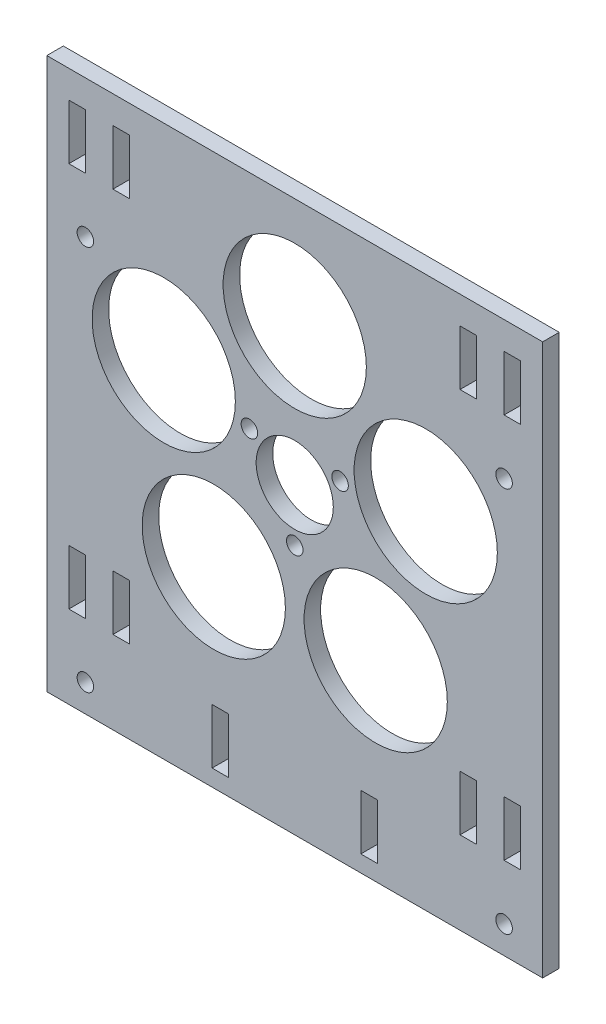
ISO-10303-21;
HEADER;
FILE_DESCRIPTION(('STEP AP214'),'2;1');
FILE_NAME('part.step','',(''),(''),'','','');
FILE_SCHEMA(('AUTOMOTIVE_DESIGN { 1 0 10303 214 1 1 1 1 }'));
ENDSEC;
DATA;
#1=APPLICATION_CONTEXT('core data for automotive mechanical design processes');
#2=APPLICATION_PROTOCOL_DEFINITION('international standard','automotive_design',2000,#1);
#3=PRODUCT_CONTEXT('',#1,'mechanical');
#4=PRODUCT('Part','Part','',(#3));
#5=PRODUCT_RELATED_PRODUCT_CATEGORY('part','',(#4));
#6=PRODUCT_DEFINITION_FORMATION('','',#4);
#7=PRODUCT_DEFINITION_CONTEXT('part definition',#1,'design');
#8=PRODUCT_DEFINITION('design','',#6,#7);
#9=PRODUCT_DEFINITION_SHAPE('','',#8);
#10=(LENGTH_UNIT() NAMED_UNIT(*) SI_UNIT(.MILLI.,.METRE.));
#11=(NAMED_UNIT(*) PLANE_ANGLE_UNIT() SI_UNIT($,.RADIAN.));
#12=(NAMED_UNIT(*) SI_UNIT($,.STERADIAN.) SOLID_ANGLE_UNIT());
#13=UNCERTAINTY_MEASURE_WITH_UNIT(LENGTH_MEASURE(1.E-05),#10,'distance_accuracy_value','');
#14=(GEOMETRIC_REPRESENTATION_CONTEXT(3) GLOBAL_UNCERTAINTY_ASSIGNED_CONTEXT((#13)) GLOBAL_UNIT_ASSIGNED_CONTEXT((#10,
#11,#12)) REPRESENTATION_CONTEXT('',''));
#15=CARTESIAN_POINT('',(0.,0.,0.));
#16=DIRECTION('',(0.,0.,1.));
#17=DIRECTION('',(1.,0.,0.));
#18=AXIS2_PLACEMENT_3D('',#15,#16,#17);
#19=CARTESIAN_POINT('',(44.9999999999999,1.2490009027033E-13,3.));
#20=DIRECTION('',(1.,0.,0.));
#21=DIRECTION('',(0.,1.,0.));
#22=AXIS2_PLACEMENT_3D('',#19,#20,#21);
#23=PLANE('',#22);
#24=DIRECTION('',(0.,-1.,0.));
#25=VECTOR('',#24,1.);
#26=CARTESIAN_POINT('',(44.9999999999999,1.2490009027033E-13,0.));
#27=LINE('',#26,#25);
#28=CARTESIAN_POINT('',(45.,45.,0.));
#29=VERTEX_POINT('',#28);
#30=CARTESIAN_POINT('',(45.,-55.,0.));
#31=VERTEX_POINT('',#30);
#32=EDGE_CURVE('E567',#29,#31,#27,.T.);
#33=ORIENTED_EDGE('',*,*,#32,.F.);
#34=DIRECTION('',(0.,0.,-1.));
#35=VECTOR('',#34,1.);
#36=CARTESIAN_POINT('',(45.,45.,3.));
#37=LINE('',#36,#35);
#38=CARTESIAN_POINT('',(45.,45.,3.));
#39=VERTEX_POINT('',#38);
#40=EDGE_CURVE('E602',#39,#29,#37,.T.);
#41=ORIENTED_EDGE('',*,*,#40,.F.);
#42=DIRECTION('',(0.,-1.,0.));
#43=VECTOR('',#42,1.);
#44=CARTESIAN_POINT('',(44.9999999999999,1.2490009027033E-13,3.));
#45=LINE('',#44,#43);
#46=CARTESIAN_POINT('',(45.,-55.,3.));
#47=VERTEX_POINT('',#46);
#48=EDGE_CURVE('E574',#39,#47,#45,.T.);
#49=ORIENTED_EDGE('',*,*,#48,.T.);
#50=DIRECTION('',(0.,0.,-1.));
#51=VECTOR('',#50,1.);
#52=CARTESIAN_POINT('',(45.,-55.,3.));
#53=LINE('',#52,#51);
#54=EDGE_CURVE('E586',#47,#31,#53,.T.);
#55=ORIENTED_EDGE('',*,*,#54,.T.);
#56=EDGE_LOOP('',(#33,#41,#49,#55));
#57=FACE_BOUND('',#56,.T.);
#58=ADVANCED_FACE('F34',(#57),#23,.T.);
#59=CARTESIAN_POINT('',(0.,45.,3.));
#60=DIRECTION('',(0.,1.,0.));
#61=DIRECTION('',(0.,0.,1.));
#62=AXIS2_PLACEMENT_3D('',#59,#60,#61);
#63=PLANE('',#62);
#64=DIRECTION('',(1.,0.,0.));
#65=VECTOR('',#64,1.);
#66=CARTESIAN_POINT('',(0.,45.,0.));
#67=LINE('',#66,#65);
#68=CARTESIAN_POINT('',(-45.,45.,0.));
#69=VERTEX_POINT('',#68);
#70=EDGE_CURVE('E589',#69,#29,#67,.T.);
#71=ORIENTED_EDGE('',*,*,#70,.F.);
#72=DIRECTION('',(0.,0.,-1.));
#73=VECTOR('',#72,1.);
#74=CARTESIAN_POINT('',(-45.,45.,3.));
#75=LINE('',#74,#73);
#76=CARTESIAN_POINT('',(-45.,45.,3.));
#77=VERTEX_POINT('',#76);
#78=EDGE_CURVE('E600',#77,#69,#75,.T.);
#79=ORIENTED_EDGE('',*,*,#78,.F.);
#80=DIRECTION('',(1.,0.,0.));
#81=VECTOR('',#80,1.);
#82=CARTESIAN_POINT('',(0.,45.,3.));
#83=LINE('',#82,#81);
#84=EDGE_CURVE('E577',#77,#39,#83,.T.);
#85=ORIENTED_EDGE('',*,*,#84,.T.);
#86=ORIENTED_EDGE('',*,*,#40,.T.);
#87=EDGE_LOOP('',(#71,#79,#85,#86));
#88=FACE_BOUND('',#87,.T.);
#89=ADVANCED_FACE('F766',(#88),#63,.T.);
#90=CARTESIAN_POINT('',(-45.,0.,3.));
#91=DIRECTION('',(-1.,0.,0.));
#92=DIRECTION('',(0.,-1.,0.));
#93=AXIS2_PLACEMENT_3D('',#90,#91,#92);
#94=PLANE('',#93);
#95=DIRECTION('',(0.,1.,0.));
#96=VECTOR('',#95,1.);
#97=CARTESIAN_POINT('',(-45.,0.,0.));
#98=LINE('',#97,#96);
#99=CARTESIAN_POINT('',(-45.,-55.,0.));
#100=VERTEX_POINT('',#99);
#101=EDGE_CURVE('E592',#100,#69,#98,.T.);
#102=ORIENTED_EDGE('',*,*,#101,.F.);
#103=DIRECTION('',(0.,0.,-1.));
#104=VECTOR('',#103,1.);
#105=CARTESIAN_POINT('',(-45.,-55.,3.));
#106=LINE('',#105,#104);
#107=CARTESIAN_POINT('',(-45.,-55.,3.));
#108=VERTEX_POINT('',#107);
#109=EDGE_CURVE('E598',#108,#100,#106,.T.);
#110=ORIENTED_EDGE('',*,*,#109,.F.);
#111=DIRECTION('',(0.,1.,0.));
#112=VECTOR('',#111,1.);
#113=CARTESIAN_POINT('',(-45.,0.,3.));
#114=LINE('',#113,#112);
#115=EDGE_CURVE('E581',#108,#77,#114,.T.);
#116=ORIENTED_EDGE('',*,*,#115,.T.);
#117=ORIENTED_EDGE('',*,*,#78,.T.);
#118=EDGE_LOOP('',(#102,#110,#116,#117));
#119=FACE_BOUND('',#118,.T.);
#120=ADVANCED_FACE('F771',(#119),#94,.T.);
#121=CARTESIAN_POINT('',(0.,-55.,3.));
#122=DIRECTION('',(0.,1.,0.));
#123=DIRECTION('',(0.,0.,1.));
#124=AXIS2_PLACEMENT_3D('',#121,#122,#123);
#125=PLANE('',#124);
#126=DIRECTION('',(1.,0.,0.));
#127=VECTOR('',#126,1.);
#128=CARTESIAN_POINT('',(0.,-55.,0.));
#129=LINE('',#128,#127);
#130=EDGE_CURVE('E578',#100,#31,#129,.T.);
#131=ORIENTED_EDGE('',*,*,#130,.T.);
#132=ORIENTED_EDGE('',*,*,#54,.F.);
#133=DIRECTION('',(1.,0.,0.));
#134=VECTOR('',#133,1.);
#135=CARTESIAN_POINT('',(0.,-55.,3.));
#136=LINE('',#135,#134);
#137=EDGE_CURVE('E584',#108,#47,#136,.T.);
#138=ORIENTED_EDGE('',*,*,#137,.F.);
#139=ORIENTED_EDGE('',*,*,#109,.T.);
#140=EDGE_LOOP('',(#131,#132,#138,#139));
#141=FACE_BOUND('',#140,.T.);
#142=ADVANCED_FACE('F786',(#141),#125,.F.);
#143=CARTESIAN_POINT('',(0.,0.,3.));
#144=DIRECTION('',(0.,0.,1.));
#145=DIRECTION('',(1.,0.,0.));
#146=AXIS2_PLACEMENT_3D('',#143,#144,#145);
#147=PLANE('',#146);
#148=CARTESIAN_POINT('',(-38.,20.,3.));
#149=DIRECTION('',(0.,0.,1.));
#150=DIRECTION('',(1.,0.,0.));
#151=AXIS2_PLACEMENT_3D('',#148,#149,#150);
#152=CIRCLE('',#151,1.5);
#153=CARTESIAN_POINT('',(-36.5,20.,3.));
#154=VERTEX_POINT('',#153);
#155=EDGE_CURVE('E357',#154,#154,#152,.T.);
#156=ORIENTED_EDGE('',*,*,#155,.F.);
#157=EDGE_LOOP('',(#156));
#158=FACE_BOUND('',#157,.T.);
#159=CARTESIAN_POINT('',(-38.,-50.,3.));
#160=DIRECTION('',(0.,0.,1.));
#161=DIRECTION('',(1.,0.,0.));
#162=AXIS2_PLACEMENT_3D('',#159,#160,#161);
#163=CIRCLE('',#162,1.5);
#164=CARTESIAN_POINT('',(-36.5,-50.,3.));
#165=VERTEX_POINT('',#164);
#166=EDGE_CURVE('E354',#165,#165,#163,.T.);
#167=ORIENTED_EDGE('',*,*,#166,.F.);
#168=EDGE_LOOP('',(#167));
#169=FACE_BOUND('',#168,.T.);
#170=DIRECTION('',(0.,-1.,0.));
#171=VECTOR('',#170,1.);
#172=CARTESIAN_POINT('',(-15.,-52.,3.));
#173=LINE('',#172,#171);
#174=CARTESIAN_POINT('',(-15.,-42.,3.));
#175=VERTEX_POINT('',#174);
#176=CARTESIAN_POINT('',(-15.,-52.,3.));
#177=VERTEX_POINT('',#176);
#178=EDGE_CURVE('E50',#175,#177,#173,.T.);
#179=ORIENTED_EDGE('',*,*,#178,.F.);
#180=DIRECTION('',(-1.,0.,0.));
#181=VECTOR('',#180,1.);
#182=CARTESIAN_POINT('',(-15.,-42.,3.));
#183=LINE('',#182,#181);
#184=CARTESIAN_POINT('',(-12.,-42.,3.));
#185=VERTEX_POINT('',#184);
#186=EDGE_CURVE('E388',#185,#175,#183,.T.);
#187=ORIENTED_EDGE('',*,*,#186,.F.);
#188=DIRECTION('',(0.,1.,0.));
#189=VECTOR('',#188,1.);
#190=CARTESIAN_POINT('',(-12.,-42.,3.));
#191=LINE('',#190,#189);
#192=CARTESIAN_POINT('',(-12.,-52.,3.));
#193=VERTEX_POINT('',#192);
#194=EDGE_CURVE('E385',#193,#185,#191,.T.);
#195=ORIENTED_EDGE('',*,*,#194,.F.);
#196=DIRECTION('',(1.,0.,0.));
#197=VECTOR('',#196,1.);
#198=CARTESIAN_POINT('',(-12.,-52.,3.));
#199=LINE('',#198,#197);
#200=EDGE_CURVE('E382',#177,#193,#199,.T.);
#201=ORIENTED_EDGE('',*,*,#200,.F.);
#202=EDGE_LOOP('',(#179,#187,#195,#201));
#203=FACE_BOUND('',#202,.T.);
#204=DIRECTION('',(-1.,0.,0.));
#205=VECTOR('',#204,1.);
#206=CARTESIAN_POINT('',(-38.,40.,3.));
#207=LINE('',#206,#205);
#208=CARTESIAN_POINT('',(-38.,40.,3.));
#209=VERTEX_POINT('',#208);
#210=CARTESIAN_POINT('',(-41.,40.,3.));
#211=VERTEX_POINT('',#210);
#212=EDGE_CURVE('E58',#209,#211,#207,.T.);
#213=ORIENTED_EDGE('',*,*,#212,.F.);
#214=DIRECTION('',(0.,1.,0.));
#215=VECTOR('',#214,1.);
#216=CARTESIAN_POINT('',(-38.,30.,3.));
#217=LINE('',#216,#215);
#218=CARTESIAN_POINT('',(-38.,30.,3.));
#219=VERTEX_POINT('',#218);
#220=EDGE_CURVE('E369',#219,#209,#217,.T.);
#221=ORIENTED_EDGE('',*,*,#220,.F.);
#222=DIRECTION('',(1.,0.,0.));
#223=VECTOR('',#222,1.);
#224=CARTESIAN_POINT('',(-41.,30.,3.));
#225=LINE('',#224,#223);
#226=CARTESIAN_POINT('',(-41.,30.,3.));
#227=VERTEX_POINT('',#226);
#228=EDGE_CURVE('E366',#227,#219,#225,.T.);
#229=ORIENTED_EDGE('',*,*,#228,.F.);
#230=DIRECTION('',(0.,-1.,0.));
#231=VECTOR('',#230,1.);
#232=CARTESIAN_POINT('',(-41.,40.,3.));
#233=LINE('',#232,#231);
#234=EDGE_CURVE('E362',#211,#227,#233,.T.);
#235=ORIENTED_EDGE('',*,*,#234,.F.);
#236=EDGE_LOOP('',(#213,#221,#229,#235));
#237=FACE_BOUND('',#236,.T.);
#238=DIRECTION('',(0.,-1.,0.));
#239=VECTOR('',#238,1.);
#240=CARTESIAN_POINT('',(38.,30.,3.));
#241=LINE('',#240,#239);
#242=CARTESIAN_POINT('',(38.,40.,3.));
#243=VERTEX_POINT('',#242);
#244=CARTESIAN_POINT('',(38.,30.,3.));
#245=VERTEX_POINT('',#244);
#246=EDGE_CURVE('E351',#243,#245,#241,.T.);
#247=ORIENTED_EDGE('',*,*,#246,.F.);
#248=DIRECTION('',(-1.,0.,0.));
#249=VECTOR('',#248,1.);
#250=CARTESIAN_POINT('',(38.,40.,3.));
#251=LINE('',#250,#249);
#252=CARTESIAN_POINT('',(41.,40.,3.));
#253=VERTEX_POINT('',#252);
#254=EDGE_CURVE('E427',#253,#243,#251,.T.);
#255=ORIENTED_EDGE('',*,*,#254,.F.);
#256=DIRECTION('',(0.,1.,0.));
#257=VECTOR('',#256,1.);
#258=CARTESIAN_POINT('',(41.,40.,3.));
#259=LINE('',#258,#257);
#260=CARTESIAN_POINT('',(41.,30.,3.));
#261=VERTEX_POINT('',#260);
#262=EDGE_CURVE('E424',#261,#253,#259,.T.);
#263=ORIENTED_EDGE('',*,*,#262,.F.);
#264=DIRECTION('',(1.,0.,0.));
#265=VECTOR('',#264,1.);
#266=CARTESIAN_POINT('',(41.,30.,3.));
#267=LINE('',#266,#265);
#268=EDGE_CURVE('E421',#245,#261,#267,.T.);
#269=ORIENTED_EDGE('',*,*,#268,.F.);
#270=EDGE_LOOP('',(#247,#255,#263,#269));
#271=FACE_BOUND('',#270,.T.);
#272=DIRECTION('',(1.,0.,0.));
#273=VECTOR('',#272,1.);
#274=CARTESIAN_POINT('',(12.,-52.,3.));
#275=LINE('',#274,#273);
#276=CARTESIAN_POINT('',(12.,-52.,3.));
#277=VERTEX_POINT('',#276);
#278=CARTESIAN_POINT('',(15.,-52.,3.));
#279=VERTEX_POINT('',#278);
#280=EDGE_CURVE('E398',#277,#279,#275,.T.);
#281=ORIENTED_EDGE('',*,*,#280,.F.);
#282=DIRECTION('',(0.,-1.,0.));
#283=VECTOR('',#282,1.);
#284=CARTESIAN_POINT('',(12.,-42.,3.));
#285=LINE('',#284,#283);
#286=CARTESIAN_POINT('',(12.,-42.,3.));
#287=VERTEX_POINT('',#286);
#288=EDGE_CURVE('E407',#287,#277,#285,.T.);
#289=ORIENTED_EDGE('',*,*,#288,.F.);
#290=DIRECTION('',(-1.,0.,0.));
#291=VECTOR('',#290,1.);
#292=CARTESIAN_POINT('',(15.,-42.,3.));
#293=LINE('',#292,#291);
#294=CARTESIAN_POINT('',(15.,-42.,3.));
#295=VERTEX_POINT('',#294);
#296=EDGE_CURVE('E404',#295,#287,#293,.T.);
#297=ORIENTED_EDGE('',*,*,#296,.F.);
#298=DIRECTION('',(0.,1.,0.));
#299=VECTOR('',#298,1.);
#300=CARTESIAN_POINT('',(15.,-52.,3.));
#301=LINE('',#300,#299);
#302=EDGE_CURVE('E400',#279,#295,#301,.T.);
#303=ORIENTED_EDGE('',*,*,#302,.F.);
#304=EDGE_LOOP('',(#281,#289,#297,#303));
#305=FACE_BOUND('',#304,.T.);
#306=CARTESIAN_POINT('',(38.,-50.,3.));
#307=DIRECTION('',(0.,0.,1.));
#308=DIRECTION('',(-1.,0.,0.));
#309=AXIS2_PLACEMENT_3D('',#306,#307,#308);
#310=CIRCLE('',#309,1.5);
#311=CARTESIAN_POINT('',(36.5,-50.,3.));
#312=VERTEX_POINT('',#311);
#313=EDGE_CURVE('E413',#312,#312,#310,.T.);
#314=ORIENTED_EDGE('',*,*,#313,.F.);
#315=EDGE_LOOP('',(#314));
#316=FACE_BOUND('',#315,.T.);
#317=CARTESIAN_POINT('',(38.,20.,3.));
#318=DIRECTION('',(0.,0.,1.));
#319=DIRECTION('',(-1.,0.,0.));
#320=AXIS2_PLACEMENT_3D('',#317,#318,#319);
#321=CIRCLE('',#320,1.5);
#322=CARTESIAN_POINT('',(36.5,20.,3.));
#323=VERTEX_POINT('',#322);
#324=EDGE_CURVE('E360',#323,#323,#321,.T.);
#325=ORIENTED_EDGE('',*,*,#324,.F.);
#326=EDGE_LOOP('',(#325));
#327=FACE_BOUND('',#326,.T.);
#328=DIRECTION('',(0.,1.,0.));
#329=VECTOR('',#328,1.);
#330=CARTESIAN_POINT('',(41.,-40.,3.));
#331=LINE('',#330,#329);
#332=CARTESIAN_POINT('',(41.,-40.,3.));
#333=VERTEX_POINT('',#332);
#334=CARTESIAN_POINT('',(41.,-30.,3.));
#335=VERTEX_POINT('',#334);
#336=EDGE_CURVE('E339',#333,#335,#331,.T.);
#337=ORIENTED_EDGE('',*,*,#336,.F.);
#338=DIRECTION('',(1.,0.,0.));
#339=VECTOR('',#338,1.);
#340=CARTESIAN_POINT('',(38.,-40.,3.));
#341=LINE('',#340,#339);
#342=CARTESIAN_POINT('',(38.,-40.,3.));
#343=VERTEX_POINT('',#342);
#344=EDGE_CURVE('E344',#343,#333,#341,.T.);
#345=ORIENTED_EDGE('',*,*,#344,.F.);
#346=DIRECTION('',(0.,-1.,0.));
#347=VECTOR('',#346,1.);
#348=CARTESIAN_POINT('',(38.,-30.,3.));
#349=LINE('',#348,#347);
#350=CARTESIAN_POINT('',(38.,-30.,3.));
#351=VERTEX_POINT('',#350);
#352=EDGE_CURVE('E323',#351,#343,#349,.T.);
#353=ORIENTED_EDGE('',*,*,#352,.F.);
#354=DIRECTION('',(-1.,0.,0.));
#355=VECTOR('',#354,1.);
#356=CARTESIAN_POINT('',(41.,-30.,3.));
#357=LINE('',#356,#355);
#358=EDGE_CURVE('E334',#335,#351,#357,.T.);
#359=ORIENTED_EDGE('',*,*,#358,.F.);
#360=EDGE_LOOP('',(#337,#345,#353,#359));
#361=FACE_BOUND('',#360,.T.);
#362=DIRECTION('',(-1.,0.,0.));
#363=VECTOR('',#362,1.);
#364=CARTESIAN_POINT('',(-41.,-30.,3.));
#365=LINE('',#364,#363);
#366=CARTESIAN_POINT('',(-38.,-30.,3.));
#367=VERTEX_POINT('',#366);
#368=CARTESIAN_POINT('',(-41.,-30.,3.));
#369=VERTEX_POINT('',#368);
#370=EDGE_CURVE('E375',#367,#369,#365,.T.);
#371=ORIENTED_EDGE('',*,*,#370,.F.);
#372=DIRECTION('',(0.,1.,0.));
#373=VECTOR('',#372,1.);
#374=CARTESIAN_POINT('',(-38.,-30.,3.));
#375=LINE('',#374,#373);
#376=CARTESIAN_POINT('',(-38.,-40.,3.));
#377=VERTEX_POINT('',#376);
#378=EDGE_CURVE('E449',#377,#367,#375,.T.);
#379=ORIENTED_EDGE('',*,*,#378,.F.);
#380=DIRECTION('',(1.,0.,0.));
#381=VECTOR('',#380,1.);
#382=CARTESIAN_POINT('',(-38.,-40.,3.));
#383=LINE('',#382,#381);
#384=CARTESIAN_POINT('',(-41.,-40.,3.));
#385=VERTEX_POINT('',#384);
#386=EDGE_CURVE('E446',#385,#377,#383,.T.);
#387=ORIENTED_EDGE('',*,*,#386,.F.);
#388=DIRECTION('',(0.,-1.,0.));
#389=VECTOR('',#388,1.);
#390=CARTESIAN_POINT('',(-41.,-40.,3.));
#391=LINE('',#390,#389);
#392=EDGE_CURVE('E443',#369,#385,#391,.T.);
#393=ORIENTED_EDGE('',*,*,#392,.F.);
#394=EDGE_LOOP('',(#371,#379,#387,#393));
#395=FACE_BOUND('',#394,.T.);
#396=CARTESIAN_POINT('',(8.22724133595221,4.74999999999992,3.));
#397=DIRECTION('',(0.,0.,1.));
#398=DIRECTION('',(1.,0.,0.));
#399=AXIS2_PLACEMENT_3D('',#396,#397,#398);
#400=CIRCLE('',#399,1.5);
#401=CARTESIAN_POINT('',(9.72724133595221,4.74999999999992,3.));
#402=VERTEX_POINT('',#401);
#403=EDGE_CURVE('E469',#402,#402,#400,.T.);
#404=ORIENTED_EDGE('',*,*,#403,.F.);
#405=EDGE_LOOP('',(#404));
#406=FACE_BOUND('',#405,.T.);
#407=CARTESIAN_POINT('',(-8.22724133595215,4.75000000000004,3.));
#408=DIRECTION('',(0.,0.,1.));
#409=DIRECTION('',(1.,0.,0.));
#410=AXIS2_PLACEMENT_3D('',#407,#408,#409);
#411=CIRCLE('',#410,1.5);
#412=CARTESIAN_POINT('',(-6.72724133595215,4.75000000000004,3.));
#413=VERTEX_POINT('',#412);
#414=EDGE_CURVE('E466',#413,#413,#411,.T.);
#415=ORIENTED_EDGE('',*,*,#414,.F.);
#416=EDGE_LOOP('',(#415));
#417=FACE_BOUND('',#416,.T.);
#418=CARTESIAN_POINT('',(0.,-9.5,3.));
#419=DIRECTION('',(0.,0.,1.));
#420=DIRECTION('',(1.,0.,0.));
#421=AXIS2_PLACEMENT_3D('',#418,#419,#420);
#422=CIRCLE('',#421,1.5);
#423=CARTESIAN_POINT('',(1.5,-9.5,3.));
#424=VERTEX_POINT('',#423);
#425=EDGE_CURVE('E462',#424,#424,#422,.T.);
#426=ORIENTED_EDGE('',*,*,#425,.F.);
#427=EDGE_LOOP('',(#426));
#428=FACE_BOUND('',#427,.T.);
#429=CARTESIAN_POINT('',(0.,0.,3.));
#430=DIRECTION('',(0.,0.,1.));
#431=DIRECTION('',(1.,0.,0.));
#432=AXIS2_PLACEMENT_3D('',#429,#430,#431);
#433=CIRCLE('',#432,7.);
#434=CARTESIAN_POINT('',(7.,0.,3.));
#435=VERTEX_POINT('',#434);
#436=EDGE_CURVE('E465',#435,#435,#433,.T.);
#437=ORIENTED_EDGE('',*,*,#436,.F.);
#438=EDGE_LOOP('',(#437));
#439=FACE_BOUND('',#438,.T.);
#440=CARTESIAN_POINT('',(-23.7764129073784,7.72542485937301,3.));
#441=DIRECTION('',(0.,0.,1.));
#442=DIRECTION('',(1.,0.,0.));
#443=AXIS2_PLACEMENT_3D('',#440,#441,#442);
#444=CIRCLE('',#443,13.);
#445=CARTESIAN_POINT('',(-10.7764129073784,7.72542485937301,3.));
#446=VERTEX_POINT('',#445);
#447=EDGE_CURVE('E485',#446,#446,#444,.T.);
#448=ORIENTED_EDGE('',*,*,#447,.F.);
#449=EDGE_LOOP('',(#448));
#450=FACE_BOUND('',#449,.T.);
#451=CARTESIAN_POINT('',(-14.6946313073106,-20.2254248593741,3.));
#452=DIRECTION('',(0.,0.,1.));
#453=DIRECTION('',(1.,0.,0.));
#454=AXIS2_PLACEMENT_3D('',#451,#452,#453);
#455=CIRCLE('',#454,13.);
#456=CARTESIAN_POINT('',(-1.69463130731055,-20.2254248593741,3.));
#457=VERTEX_POINT('',#456);
#458=EDGE_CURVE('E482',#457,#457,#455,.T.);
#459=ORIENTED_EDGE('',*,*,#458,.F.);
#460=EDGE_LOOP('',(#459));
#461=FACE_BOUND('',#460,.T.);
#462=CARTESIAN_POINT('',(14.6946313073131,-20.2254248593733,3.));
#463=DIRECTION('',(0.,0.,1.));
#464=DIRECTION('',(1.,0.,0.));
#465=AXIS2_PLACEMENT_3D('',#462,#463,#464);
#466=CIRCLE('',#465,13.);
#467=CARTESIAN_POINT('',(27.6946313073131,-20.2254248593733,3.));
#468=VERTEX_POINT('',#467);
#469=EDGE_CURVE('E479',#468,#468,#466,.T.);
#470=ORIENTED_EDGE('',*,*,#469,.F.);
#471=EDGE_LOOP('',(#470));
#472=FACE_BOUND('',#471,.T.);
#473=CARTESIAN_POINT('',(23.7764129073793,7.72542485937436,3.));
#474=DIRECTION('',(0.,0.,1.));
#475=DIRECTION('',(1.,0.,0.));
#476=AXIS2_PLACEMENT_3D('',#473,#474,#475);
#477=CIRCLE('',#476,13.);
#478=CARTESIAN_POINT('',(36.7764129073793,7.72542485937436,3.));
#479=VERTEX_POINT('',#478);
#480=EDGE_CURVE('E475',#479,#479,#477,.T.);
#481=ORIENTED_EDGE('',*,*,#480,.F.);
#482=EDGE_LOOP('',(#481));
#483=FACE_BOUND('',#482,.T.);
#484=CARTESIAN_POINT('',(0.,25.,3.));
#485=DIRECTION('',(0.,0.,1.));
#486=DIRECTION('',(1.,0.,0.));
#487=AXIS2_PLACEMENT_3D('',#484,#485,#486);
#488=CIRCLE('',#487,13.);
#489=CARTESIAN_POINT('',(13.,25.,3.));
#490=VERTEX_POINT('',#489);
#491=EDGE_CURVE('E478',#490,#490,#488,.T.);
#492=ORIENTED_EDGE('',*,*,#491,.F.);
#493=EDGE_LOOP('',(#492));
#494=FACE_BOUND('',#493,.T.);
#495=DIRECTION('',(-1.,0.,0.));
#496=VECTOR('',#495,1.);
#497=CARTESIAN_POINT('',(33.,40.,3.));
#498=LINE('',#497,#496);
#499=CARTESIAN_POINT('',(33.,40.,3.));
#500=VERTEX_POINT('',#499);
#501=CARTESIAN_POINT('',(30.,40.,3.));
#502=VERTEX_POINT('',#501);
#503=EDGE_CURVE('E514',#500,#502,#498,.T.);
#504=ORIENTED_EDGE('',*,*,#503,.F.);
#505=DIRECTION('',(0.,1.,0.));
#506=VECTOR('',#505,1.);
#507=CARTESIAN_POINT('',(33.,30.,3.));
#508=LINE('',#507,#506);
#509=CARTESIAN_POINT('',(33.,30.,3.));
#510=VERTEX_POINT('',#509);
#511=EDGE_CURVE('E523',#510,#500,#508,.T.);
#512=ORIENTED_EDGE('',*,*,#511,.F.);
#513=DIRECTION('',(1.,0.,0.));
#514=VECTOR('',#513,1.);
#515=CARTESIAN_POINT('',(30.,30.,3.));
#516=LINE('',#515,#514);
#517=CARTESIAN_POINT('',(30.,30.,3.));
#518=VERTEX_POINT('',#517);
#519=EDGE_CURVE('E520',#518,#510,#516,.T.);
#520=ORIENTED_EDGE('',*,*,#519,.F.);
#521=DIRECTION('',(0.,-1.,0.));
#522=VECTOR('',#521,1.);
#523=CARTESIAN_POINT('',(30.,40.,3.));
#524=LINE('',#523,#522);
#525=EDGE_CURVE('E516',#502,#518,#524,.T.);
#526=ORIENTED_EDGE('',*,*,#525,.F.);
#527=EDGE_LOOP('',(#504,#512,#520,#526));
#528=FACE_BOUND('',#527,.T.);
#529=DIRECTION('',(-1.,0.,0.));
#530=VECTOR('',#529,1.);
#531=CARTESIAN_POINT('',(-30.,-30.,3.));
#532=LINE('',#531,#530);
#533=CARTESIAN_POINT('',(-30.,-30.,3.));
#534=VERTEX_POINT('',#533);
#535=CARTESIAN_POINT('',(-33.,-30.,3.));
#536=VERTEX_POINT('',#535);
#537=EDGE_CURVE('E507',#534,#536,#532,.T.);
#538=ORIENTED_EDGE('',*,*,#537,.F.);
#539=DIRECTION('',(0.,1.,0.));
#540=VECTOR('',#539,1.);
#541=CARTESIAN_POINT('',(-30.,-40.,3.));
#542=LINE('',#541,#540);
#543=CARTESIAN_POINT('',(-30.,-40.,3.));
#544=VERTEX_POINT('',#543);
#545=EDGE_CURVE('E543',#544,#534,#542,.T.);
#546=ORIENTED_EDGE('',*,*,#545,.F.);
#547=DIRECTION('',(1.,0.,0.));
#548=VECTOR('',#547,1.);
#549=CARTESIAN_POINT('',(-33.,-40.,3.));
#550=LINE('',#549,#548);
#551=CARTESIAN_POINT('',(-33.,-40.,3.));
#552=VERTEX_POINT('',#551);
#553=EDGE_CURVE('E540',#552,#544,#550,.T.);
#554=ORIENTED_EDGE('',*,*,#553,.F.);
#555=DIRECTION('',(0.,-1.,0.));
#556=VECTOR('',#555,1.);
#557=CARTESIAN_POINT('',(-33.,-30.,3.));
#558=LINE('',#557,#556);
#559=EDGE_CURVE('E537',#536,#552,#558,.T.);
#560=ORIENTED_EDGE('',*,*,#559,.F.);
#561=EDGE_LOOP('',(#538,#546,#554,#560));
#562=FACE_BOUND('',#561,.T.);
#563=DIRECTION('',(-1.,0.,0.));
#564=VECTOR('',#563,1.);
#565=CARTESIAN_POINT('',(33.,-30.,3.));
#566=LINE('',#565,#564);
#567=CARTESIAN_POINT('',(33.,-30.,3.));
#568=VERTEX_POINT('',#567);
#569=CARTESIAN_POINT('',(30.,-30.,3.));
#570=VERTEX_POINT('',#569);
#571=EDGE_CURVE('E492',#568,#570,#566,.T.);
#572=ORIENTED_EDGE('',*,*,#571,.F.);
#573=DIRECTION('',(0.,1.,0.));
#574=VECTOR('',#573,1.);
#575=CARTESIAN_POINT('',(33.,-40.,3.));
#576=LINE('',#575,#574);
#577=CARTESIAN_POINT('',(33.,-40.,3.));
#578=VERTEX_POINT('',#577);
#579=EDGE_CURVE('E501',#578,#568,#576,.T.);
#580=ORIENTED_EDGE('',*,*,#579,.F.);
#581=DIRECTION('',(1.,0.,0.));
#582=VECTOR('',#581,1.);
#583=CARTESIAN_POINT('',(30.,-40.,3.));
#584=LINE('',#583,#582);
#585=CARTESIAN_POINT('',(30.,-40.,3.));
#586=VERTEX_POINT('',#585);
#587=EDGE_CURVE('E498',#586,#578,#584,.T.);
#588=ORIENTED_EDGE('',*,*,#587,.F.);
#589=DIRECTION('',(0.,-1.,0.));
#590=VECTOR('',#589,1.);
#591=CARTESIAN_POINT('',(30.,-30.,3.));
#592=LINE('',#591,#590);
#593=EDGE_CURVE('E494',#570,#586,#592,.T.);
#594=ORIENTED_EDGE('',*,*,#593,.F.);
#595=EDGE_LOOP('',(#572,#580,#588,#594));
#596=FACE_BOUND('',#595,.T.);
#597=DIRECTION('',(-1.,0.,0.));
#598=VECTOR('',#597,1.);
#599=CARTESIAN_POINT('',(-30.,40.,3.));
#600=LINE('',#599,#598);
#601=CARTESIAN_POINT('',(-30.,40.,3.));
#602=VERTEX_POINT('',#601);
#603=CARTESIAN_POINT('',(-33.,40.,3.));
#604=VERTEX_POINT('',#603);
#605=EDGE_CURVE('E529',#602,#604,#600,.T.);
#606=ORIENTED_EDGE('',*,*,#605,.F.);
#607=DIRECTION('',(0.,1.,0.));
#608=VECTOR('',#607,1.);
#609=CARTESIAN_POINT('',(-30.,30.,3.));
#610=LINE('',#609,#608);
#611=CARTESIAN_POINT('',(-30.,30.,3.));
#612=VERTEX_POINT('',#611);
#613=EDGE_CURVE('E561',#612,#602,#610,.T.);
#614=ORIENTED_EDGE('',*,*,#613,.F.);
#615=DIRECTION('',(1.,0.,0.));
#616=VECTOR('',#615,1.);
#617=CARTESIAN_POINT('',(-33.,30.,3.));
#618=LINE('',#617,#616);
#619=CARTESIAN_POINT('',(-33.,30.,3.));
#620=VERTEX_POINT('',#619);
#621=EDGE_CURVE('E558',#620,#612,#618,.T.);
#622=ORIENTED_EDGE('',*,*,#621,.F.);
#623=DIRECTION('',(0.,-1.,0.));
#624=VECTOR('',#623,1.);
#625=CARTESIAN_POINT('',(-33.,40.,3.));
#626=LINE('',#625,#624);
#627=EDGE_CURVE('E555',#604,#620,#626,.T.);
#628=ORIENTED_EDGE('',*,*,#627,.F.);
#629=EDGE_LOOP('',(#606,#614,#622,#628));
#630=FACE_BOUND('',#629,.T.);
#631=ORIENTED_EDGE('',*,*,#48,.F.);
#632=ORIENTED_EDGE('',*,*,#84,.F.);
#633=ORIENTED_EDGE('',*,*,#115,.F.);
#634=ORIENTED_EDGE('',*,*,#137,.T.);
#635=EDGE_LOOP('',(#631,#632,#633,#634));
#636=FACE_BOUND('',#635,.T.);
#637=ADVANCED_FACE('F341',(#158,#169,#203,#237,#271,#305,#316,#327,#361,#395,#406,#417,#428,
#439,#450,#461,#472,#483,#494,#528,#562,#596,#630,#636),#147,.T.);
#638=CARTESIAN_POINT('',(0.,0.,0.));
#639=DIRECTION('',(0.,0.,1.));
#640=DIRECTION('',(1.,0.,0.));
#641=AXIS2_PLACEMENT_3D('',#638,#639,#640);
#642=PLANE('',#641);
#643=CARTESIAN_POINT('',(-38.,20.,0.));
#644=DIRECTION('',(0.,0.,1.));
#645=DIRECTION('',(1.,0.,0.));
#646=AXIS2_PLACEMENT_3D('',#643,#644,#645);
#647=CIRCLE('',#646,1.5);
#648=CARTESIAN_POINT('',(-36.5,20.,0.));
#649=VERTEX_POINT('',#648);
#650=EDGE_CURVE('E37',#649,#649,#647,.T.);
#651=ORIENTED_EDGE('',*,*,#650,.T.);
#652=EDGE_LOOP('',(#651));
#653=FACE_BOUND('',#652,.T.);
#654=CARTESIAN_POINT('',(-38.,-50.,0.));
#655=DIRECTION('',(0.,0.,1.));
#656=DIRECTION('',(1.,0.,0.));
#657=AXIS2_PLACEMENT_3D('',#654,#655,#656);
#658=CIRCLE('',#657,1.5);
#659=CARTESIAN_POINT('',(-36.5,-50.,0.));
#660=VERTEX_POINT('',#659);
#661=EDGE_CURVE('E702',#660,#660,#658,.T.);
#662=ORIENTED_EDGE('',*,*,#661,.T.);
#663=EDGE_LOOP('',(#662));
#664=FACE_BOUND('',#663,.T.);
#665=DIRECTION('',(-1.,0.,0.));
#666=VECTOR('',#665,1.);
#667=CARTESIAN_POINT('',(0.,-42.,0.));
#668=LINE('',#667,#666);
#669=CARTESIAN_POINT('',(-12.,-42.,0.));
#670=VERTEX_POINT('',#669);
#671=CARTESIAN_POINT('',(-15.,-42.,0.));
#672=VERTEX_POINT('',#671);
#673=EDGE_CURVE('E42',#670,#672,#668,.T.);
#674=ORIENTED_EDGE('',*,*,#673,.T.);
#675=DIRECTION('',(0.,-1.,0.));
#676=VECTOR('',#675,1.);
#677=CARTESIAN_POINT('',(-15.,0.,0.));
#678=LINE('',#677,#676);
#679=CARTESIAN_POINT('',(-15.,-52.,0.));
#680=VERTEX_POINT('',#679);
#681=EDGE_CURVE('E11',#672,#680,#678,.T.);
#682=ORIENTED_EDGE('',*,*,#681,.T.);
#683=DIRECTION('',(1.,0.,0.));
#684=VECTOR('',#683,1.);
#685=CARTESIAN_POINT('',(0.,-52.,0.));
#686=LINE('',#685,#684);
#687=CARTESIAN_POINT('',(-12.,-52.,0.));
#688=VERTEX_POINT('',#687);
#689=EDGE_CURVE('E738',#680,#688,#686,.T.);
#690=ORIENTED_EDGE('',*,*,#689,.T.);
#691=DIRECTION('',(0.,1.,0.));
#692=VECTOR('',#691,1.);
#693=CARTESIAN_POINT('',(-12.,0.,0.));
#694=LINE('',#693,#692);
#695=EDGE_CURVE('E741',#688,#670,#694,.T.);
#696=ORIENTED_EDGE('',*,*,#695,.T.);
#697=EDGE_LOOP('',(#674,#682,#690,#696));
#698=FACE_BOUND('',#697,.T.);
#699=DIRECTION('',(0.,1.,0.));
#700=VECTOR('',#699,1.);
#701=CARTESIAN_POINT('',(-38.,0.,0.));
#702=LINE('',#701,#700);
#703=CARTESIAN_POINT('',(-38.,30.,0.));
#704=VERTEX_POINT('',#703);
#705=CARTESIAN_POINT('',(-38.,40.,0.));
#706=VERTEX_POINT('',#705);
#707=EDGE_CURVE('E732',#704,#706,#702,.T.);
#708=ORIENTED_EDGE('',*,*,#707,.T.);
#709=DIRECTION('',(-1.,0.,0.));
#710=VECTOR('',#709,1.);
#711=CARTESIAN_POINT('',(0.,40.,0.));
#712=LINE('',#711,#710);
#713=CARTESIAN_POINT('',(-41.,40.,0.));
#714=VERTEX_POINT('',#713);
#715=EDGE_CURVE('E735',#706,#714,#712,.T.);
#716=ORIENTED_EDGE('',*,*,#715,.T.);
#717=DIRECTION('',(0.,-1.,0.));
#718=VECTOR('',#717,1.);
#719=CARTESIAN_POINT('',(-41.,0.,0.));
#720=LINE('',#719,#718);
#721=CARTESIAN_POINT('',(-41.,30.,0.));
#722=VERTEX_POINT('',#721);
#723=EDGE_CURVE('E726',#714,#722,#720,.T.);
#724=ORIENTED_EDGE('',*,*,#723,.T.);
#725=DIRECTION('',(1.,0.,0.));
#726=VECTOR('',#725,1.);
#727=CARTESIAN_POINT('',(0.,30.,0.));
#728=LINE('',#727,#726);
#729=EDGE_CURVE('E729',#722,#704,#728,.T.);
#730=ORIENTED_EDGE('',*,*,#729,.T.);
#731=EDGE_LOOP('',(#708,#716,#724,#730));
#732=FACE_BOUND('',#731,.T.);
#733=DIRECTION('',(-1.,0.,0.));
#734=VECTOR('',#733,1.);
#735=CARTESIAN_POINT('',(0.,40.,0.));
#736=LINE('',#735,#734);
#737=CARTESIAN_POINT('',(41.,40.,0.));
#738=VERTEX_POINT('',#737);
#739=CARTESIAN_POINT('',(38.,40.,0.));
#740=VERTEX_POINT('',#739);
#741=EDGE_CURVE('E720',#738,#740,#736,.T.);
#742=ORIENTED_EDGE('',*,*,#741,.T.);
#743=DIRECTION('',(0.,-1.,0.));
#744=VECTOR('',#743,1.);
#745=CARTESIAN_POINT('',(38.,0.,0.));
#746=LINE('',#745,#744);
#747=CARTESIAN_POINT('',(38.,30.,0.));
#748=VERTEX_POINT('',#747);
#749=EDGE_CURVE('E723',#740,#748,#746,.T.);
#750=ORIENTED_EDGE('',*,*,#749,.T.);
#751=DIRECTION('',(1.,0.,0.));
#752=VECTOR('',#751,1.);
#753=CARTESIAN_POINT('',(0.,30.,0.));
#754=LINE('',#753,#752);
#755=CARTESIAN_POINT('',(41.,30.,0.));
#756=VERTEX_POINT('',#755);
#757=EDGE_CURVE('E714',#748,#756,#754,.T.);
#758=ORIENTED_EDGE('',*,*,#757,.T.);
#759=DIRECTION('',(0.,1.,0.));
#760=VECTOR('',#759,1.);
#761=CARTESIAN_POINT('',(41.,0.,0.));
#762=LINE('',#761,#760);
#763=EDGE_CURVE('E717',#756,#738,#762,.T.);
#764=ORIENTED_EDGE('',*,*,#763,.T.);
#765=EDGE_LOOP('',(#742,#750,#758,#764));
#766=FACE_BOUND('',#765,.T.);
#767=DIRECTION('',(0.,-1.,0.));
#768=VECTOR('',#767,1.);
#769=CARTESIAN_POINT('',(12.,0.,0.));
#770=LINE('',#769,#768);
#771=CARTESIAN_POINT('',(12.,-42.,0.));
#772=VERTEX_POINT('',#771);
#773=CARTESIAN_POINT('',(12.,-52.,0.));
#774=VERTEX_POINT('',#773);
#775=EDGE_CURVE('E708',#772,#774,#770,.T.);
#776=ORIENTED_EDGE('',*,*,#775,.T.);
#777=DIRECTION('',(1.,0.,0.));
#778=VECTOR('',#777,1.);
#779=CARTESIAN_POINT('',(0.,-52.,0.));
#780=LINE('',#779,#778);
#781=CARTESIAN_POINT('',(15.,-52.,0.));
#782=VERTEX_POINT('',#781);
#783=EDGE_CURVE('E711',#774,#782,#780,.T.);
#784=ORIENTED_EDGE('',*,*,#783,.T.);
#785=DIRECTION('',(0.,1.,0.));
#786=VECTOR('',#785,1.);
#787=CARTESIAN_POINT('',(15.,0.,0.));
#788=LINE('',#787,#786);
#789=CARTESIAN_POINT('',(15.,-42.,0.));
#790=VERTEX_POINT('',#789);
#791=EDGE_CURVE('E696',#782,#790,#788,.T.);
#792=ORIENTED_EDGE('',*,*,#791,.T.);
#793=DIRECTION('',(-1.,0.,0.));
#794=VECTOR('',#793,1.);
#795=CARTESIAN_POINT('',(0.,-42.,0.));
#796=LINE('',#795,#794);
#797=EDGE_CURVE('E705',#790,#772,#796,.T.);
#798=ORIENTED_EDGE('',*,*,#797,.T.);
#799=EDGE_LOOP('',(#776,#784,#792,#798));
#800=FACE_BOUND('',#799,.T.);
#801=CARTESIAN_POINT('',(38.,-50.,0.));
#802=DIRECTION('',(0.,0.,1.));
#803=DIRECTION('',(1.,0.,0.));
#804=AXIS2_PLACEMENT_3D('',#801,#802,#803);
#805=CIRCLE('',#804,1.5);
#806=CARTESIAN_POINT('',(39.5,-50.,0.));
#807=VERTEX_POINT('',#806);
#808=EDGE_CURVE('E699',#807,#807,#805,.T.);
#809=ORIENTED_EDGE('',*,*,#808,.T.);
#810=EDGE_LOOP('',(#809));
#811=FACE_BOUND('',#810,.T.);
#812=CARTESIAN_POINT('',(38.,20.,0.));
#813=DIRECTION('',(0.,0.,1.));
#814=DIRECTION('',(1.,0.,0.));
#815=AXIS2_PLACEMENT_3D('',#812,#813,#814);
#816=CIRCLE('',#815,1.5);
#817=CARTESIAN_POINT('',(39.5,20.,0.));
#818=VERTEX_POINT('',#817);
#819=EDGE_CURVE('E455',#818,#818,#816,.T.);
#820=ORIENTED_EDGE('',*,*,#819,.T.);
#821=EDGE_LOOP('',(#820));
#822=FACE_BOUND('',#821,.T.);
#823=DIRECTION('',(1.,0.,0.));
#824=VECTOR('',#823,1.);
#825=CARTESIAN_POINT('',(0.,-39.9999999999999,0.));
#826=LINE('',#825,#824);
#827=CARTESIAN_POINT('',(38.,-40.,0.));
#828=VERTEX_POINT('',#827);
#829=CARTESIAN_POINT('',(41.,-40.,0.));
#830=VERTEX_POINT('',#829);
#831=EDGE_CURVE('E690',#828,#830,#826,.T.);
#832=ORIENTED_EDGE('',*,*,#831,.T.);
#833=DIRECTION('',(0.,1.,0.));
#834=VECTOR('',#833,1.);
#835=CARTESIAN_POINT('',(40.9999999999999,0.,0.));
#836=LINE('',#835,#834);
#837=CARTESIAN_POINT('',(41.,-30.,0.));
#838=VERTEX_POINT('',#837);
#839=EDGE_CURVE('E693',#830,#838,#836,.T.);
#840=ORIENTED_EDGE('',*,*,#839,.T.);
#841=DIRECTION('',(-1.,0.,0.));
#842=VECTOR('',#841,1.);
#843=CARTESIAN_POINT('',(0.,-30.,0.));
#844=LINE('',#843,#842);
#845=CARTESIAN_POINT('',(38.,-30.,0.));
#846=VERTEX_POINT('',#845);
#847=EDGE_CURVE('E687',#838,#846,#844,.T.);
#848=ORIENTED_EDGE('',*,*,#847,.T.);
#849=DIRECTION('',(0.,-1.,0.));
#850=VECTOR('',#849,1.);
#851=CARTESIAN_POINT('',(38.,0.,0.));
#852=LINE('',#851,#850);
#853=EDGE_CURVE('E326',#846,#828,#852,.T.);
#854=ORIENTED_EDGE('',*,*,#853,.T.);
#855=EDGE_LOOP('',(#832,#840,#848,#854));
#856=FACE_BOUND('',#855,.T.);
#857=DIRECTION('',(0.,1.,0.));
#858=VECTOR('',#857,1.);
#859=CARTESIAN_POINT('',(-38.,0.,0.));
#860=LINE('',#859,#858);
#861=CARTESIAN_POINT('',(-38.,-40.,0.));
#862=VERTEX_POINT('',#861);
#863=CARTESIAN_POINT('',(-38.,-30.,0.));
#864=VERTEX_POINT('',#863);
#865=EDGE_CURVE('E681',#862,#864,#860,.T.);
#866=ORIENTED_EDGE('',*,*,#865,.T.);
#867=DIRECTION('',(-1.,0.,0.));
#868=VECTOR('',#867,1.);
#869=CARTESIAN_POINT('',(0.,-30.,0.));
#870=LINE('',#869,#868);
#871=CARTESIAN_POINT('',(-41.,-30.,0.));
#872=VERTEX_POINT('',#871);
#873=EDGE_CURVE('E684',#864,#872,#870,.T.);
#874=ORIENTED_EDGE('',*,*,#873,.T.);
#875=DIRECTION('',(0.,-1.,0.));
#876=VECTOR('',#875,1.);
#877=CARTESIAN_POINT('',(-41.,0.,0.));
#878=LINE('',#877,#876);
#879=CARTESIAN_POINT('',(-41.,-40.,0.));
#880=VERTEX_POINT('',#879);
#881=EDGE_CURVE('E652',#872,#880,#878,.T.);
#882=ORIENTED_EDGE('',*,*,#881,.T.);
#883=DIRECTION('',(1.,0.,0.));
#884=VECTOR('',#883,1.);
#885=CARTESIAN_POINT('',(0.,-39.9999999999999,0.));
#886=LINE('',#885,#884);
#887=EDGE_CURVE('E678',#880,#862,#886,.T.);
#888=ORIENTED_EDGE('',*,*,#887,.T.);
#889=EDGE_LOOP('',(#866,#874,#882,#888));
#890=FACE_BOUND('',#889,.T.);
#891=CARTESIAN_POINT('',(8.22724133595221,4.74999999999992,0.));
#892=DIRECTION('',(0.,0.,1.));
#893=DIRECTION('',(1.,0.,0.));
#894=AXIS2_PLACEMENT_3D('',#891,#892,#893);
#895=CIRCLE('',#894,1.5);
#896=CARTESIAN_POINT('',(9.72724133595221,4.74999999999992,0.));
#897=VERTEX_POINT('',#896);
#898=EDGE_CURVE('E488',#897,#897,#895,.T.);
#899=ORIENTED_EDGE('',*,*,#898,.T.);
#900=EDGE_LOOP('',(#899));
#901=FACE_BOUND('',#900,.T.);
#902=CARTESIAN_POINT('',(-8.22724133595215,4.75000000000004,0.));
#903=DIRECTION('',(0.,0.,1.));
#904=DIRECTION('',(1.,0.,0.));
#905=AXIS2_PLACEMENT_3D('',#902,#903,#904);
#906=CIRCLE('',#905,1.5);
#907=CARTESIAN_POINT('',(-6.72724133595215,4.75000000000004,0.));
#908=VERTEX_POINT('',#907);
#909=EDGE_CURVE('E671',#908,#908,#906,.T.);
#910=ORIENTED_EDGE('',*,*,#909,.T.);
#911=EDGE_LOOP('',(#910));
#912=FACE_BOUND('',#911,.T.);
#913=CARTESIAN_POINT('',(0.,-9.5,0.));
#914=DIRECTION('',(0.,0.,1.));
#915=DIRECTION('',(1.,0.,0.));
#916=AXIS2_PLACEMENT_3D('',#913,#914,#915);
#917=CIRCLE('',#916,1.5);
#918=CARTESIAN_POINT('',(1.5,-9.5,0.));
#919=VERTEX_POINT('',#918);
#920=EDGE_CURVE('E668',#919,#919,#917,.T.);
#921=ORIENTED_EDGE('',*,*,#920,.T.);
#922=EDGE_LOOP('',(#921));
#923=FACE_BOUND('',#922,.T.);
#924=CARTESIAN_POINT('',(0.,0.,0.));
#925=DIRECTION('',(0.,0.,1.));
#926=DIRECTION('',(1.,0.,0.));
#927=AXIS2_PLACEMENT_3D('',#924,#925,#926);
#928=CIRCLE('',#927,7.);
#929=CARTESIAN_POINT('',(7.,0.,0.));
#930=VERTEX_POINT('',#929);
#931=EDGE_CURVE('E474',#930,#930,#928,.T.);
#932=ORIENTED_EDGE('',*,*,#931,.T.);
#933=EDGE_LOOP('',(#932));
#934=FACE_BOUND('',#933,.T.);
#935=CARTESIAN_POINT('',(-23.7764129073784,7.72542485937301,0.));
#936=DIRECTION('',(0.,0.,1.));
#937=DIRECTION('',(1.,0.,0.));
#938=AXIS2_PLACEMENT_3D('',#935,#936,#937);
#939=CIRCLE('',#938,13.);
#940=CARTESIAN_POINT('',(-10.7764129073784,7.72542485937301,0.));
#941=VERTEX_POINT('',#940);
#942=EDGE_CURVE('E495',#941,#941,#939,.T.);
#943=ORIENTED_EDGE('',*,*,#942,.T.);
#944=EDGE_LOOP('',(#943));
#945=FACE_BOUND('',#944,.T.);
#946=CARTESIAN_POINT('',(-14.6946313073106,-20.2254248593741,0.));
#947=DIRECTION('',(0.,0.,1.));
#948=DIRECTION('',(1.,0.,0.));
#949=AXIS2_PLACEMENT_3D('',#946,#947,#948);
#950=CIRCLE('',#949,13.);
#951=CARTESIAN_POINT('',(-1.69463130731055,-20.2254248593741,0.));
#952=VERTEX_POINT('',#951);
#953=EDGE_CURVE('E661',#952,#952,#950,.T.);
#954=ORIENTED_EDGE('',*,*,#953,.T.);
#955=EDGE_LOOP('',(#954));
#956=FACE_BOUND('',#955,.T.);
#957=CARTESIAN_POINT('',(14.6946313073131,-20.2254248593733,0.));
#958=DIRECTION('',(0.,0.,1.));
#959=DIRECTION('',(1.,0.,0.));
#960=AXIS2_PLACEMENT_3D('',#957,#958,#959);
#961=CIRCLE('',#960,13.);
#962=CARTESIAN_POINT('',(27.6946313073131,-20.2254248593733,0.));
#963=VERTEX_POINT('',#962);
#964=EDGE_CURVE('E658',#963,#963,#961,.T.);
#965=ORIENTED_EDGE('',*,*,#964,.T.);
#966=EDGE_LOOP('',(#965));
#967=FACE_BOUND('',#966,.T.);
#968=CARTESIAN_POINT('',(23.7764129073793,7.72542485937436,0.));
#969=DIRECTION('',(0.,0.,1.));
#970=DIRECTION('',(1.,0.,0.));
#971=AXIS2_PLACEMENT_3D('',#968,#969,#970);
#972=CIRCLE('',#971,13.);
#973=CARTESIAN_POINT('',(36.7764129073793,7.72542485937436,0.));
#974=VERTEX_POINT('',#973);
#975=EDGE_CURVE('E655',#974,#974,#972,.T.);
#976=ORIENTED_EDGE('',*,*,#975,.T.);
#977=EDGE_LOOP('',(#976));
#978=FACE_BOUND('',#977,.T.);
#979=CARTESIAN_POINT('',(0.,25.,0.));
#980=DIRECTION('',(0.,0.,1.));
#981=DIRECTION('',(1.,0.,0.));
#982=AXIS2_PLACEMENT_3D('',#979,#980,#981);
#983=CIRCLE('',#982,13.);
#984=CARTESIAN_POINT('',(13.,25.,0.));
#985=VERTEX_POINT('',#984);
#986=EDGE_CURVE('E491',#985,#985,#983,.T.);
#987=ORIENTED_EDGE('',*,*,#986,.T.);
#988=EDGE_LOOP('',(#987));
#989=FACE_BOUND('',#988,.T.);
#990=DIRECTION('',(0.,1.,0.));
#991=VECTOR('',#990,1.);
#992=CARTESIAN_POINT('',(33.,0.,0.));
#993=LINE('',#992,#991);
#994=CARTESIAN_POINT('',(33.,30.,0.));
#995=VERTEX_POINT('',#994);
#996=CARTESIAN_POINT('',(33.,40.,0.));
#997=VERTEX_POINT('',#996);
#998=EDGE_CURVE('E646',#995,#997,#993,.T.);
#999=ORIENTED_EDGE('',*,*,#998,.T.);
#1000=DIRECTION('',(-1.,0.,0.));
#1001=VECTOR('',#1000,1.);
#1002=CARTESIAN_POINT('',(0.,40.,0.));
#1003=LINE('',#1002,#1001);
#1004=CARTESIAN_POINT('',(30.,40.,0.));
#1005=VERTEX_POINT('',#1004);
#1006=EDGE_CURVE('E649',#997,#1005,#1003,.T.);
#1007=ORIENTED_EDGE('',*,*,#1006,.T.);
#1008=DIRECTION('',(0.,-1.,0.));
#1009=VECTOR('',#1008,1.);
#1010=CARTESIAN_POINT('',(30.,0.,0.));
#1011=LINE('',#1010,#1009);
#1012=CARTESIAN_POINT('',(30.,30.,0.));
#1013=VERTEX_POINT('',#1012);
#1014=EDGE_CURVE('E640',#1005,#1013,#1011,.T.);
#1015=ORIENTED_EDGE('',*,*,#1014,.T.);
#1016=DIRECTION('',(1.,0.,0.));
#1017=VECTOR('',#1016,1.);
#1018=CARTESIAN_POINT('',(0.,30.,0.));
#1019=LINE('',#1018,#1017);
#1020=EDGE_CURVE('E643',#1013,#995,#1019,.T.);
#1021=ORIENTED_EDGE('',*,*,#1020,.T.);
#1022=EDGE_LOOP('',(#999,#1007,#1015,#1021));
#1023=FACE_BOUND('',#1022,.T.);
#1024=DIRECTION('',(0.,1.,0.));
#1025=VECTOR('',#1024,1.);
#1026=CARTESIAN_POINT('',(-30.,0.,0.));
#1027=LINE('',#1026,#1025);
#1028=CARTESIAN_POINT('',(-30.,-40.,0.));
#1029=VERTEX_POINT('',#1028);
#1030=CARTESIAN_POINT('',(-30.,-30.,0.));
#1031=VERTEX_POINT('',#1030);
#1032=EDGE_CURVE('E634',#1029,#1031,#1027,.T.);
#1033=ORIENTED_EDGE('',*,*,#1032,.T.);
#1034=DIRECTION('',(-1.,0.,0.));
#1035=VECTOR('',#1034,1.);
#1036=CARTESIAN_POINT('',(0.,-30.,0.));
#1037=LINE('',#1036,#1035);
#1038=CARTESIAN_POINT('',(-33.,-30.,0.));
#1039=VERTEX_POINT('',#1038);
#1040=EDGE_CURVE('E637',#1031,#1039,#1037,.T.);
#1041=ORIENTED_EDGE('',*,*,#1040,.T.);
#1042=DIRECTION('',(0.,-1.,0.));
#1043=VECTOR('',#1042,1.);
#1044=CARTESIAN_POINT('',(-33.,0.,0.));
#1045=LINE('',#1044,#1043);
#1046=CARTESIAN_POINT('',(-33.,-40.,0.));
#1047=VERTEX_POINT('',#1046);
#1048=EDGE_CURVE('E628',#1039,#1047,#1045,.T.);
#1049=ORIENTED_EDGE('',*,*,#1048,.T.);
#1050=DIRECTION('',(1.,0.,0.));
#1051=VECTOR('',#1050,1.);
#1052=CARTESIAN_POINT('',(0.,-40.,0.));
#1053=LINE('',#1052,#1051);
#1054=EDGE_CURVE('E631',#1047,#1029,#1053,.T.);
#1055=ORIENTED_EDGE('',*,*,#1054,.T.);
#1056=EDGE_LOOP('',(#1033,#1041,#1049,#1055));
#1057=FACE_BOUND('',#1056,.T.);
#1058=DIRECTION('',(0.,1.,0.));
#1059=VECTOR('',#1058,1.);
#1060=CARTESIAN_POINT('',(33.,0.,0.));
#1061=LINE('',#1060,#1059);
#1062=CARTESIAN_POINT('',(33.,-40.,0.));
#1063=VERTEX_POINT('',#1062);
#1064=CARTESIAN_POINT('',(33.,-30.,0.));
#1065=VERTEX_POINT('',#1064);
#1066=EDGE_CURVE('E622',#1063,#1065,#1061,.T.);
#1067=ORIENTED_EDGE('',*,*,#1066,.T.);
#1068=DIRECTION('',(-1.,0.,0.));
#1069=VECTOR('',#1068,1.);
#1070=CARTESIAN_POINT('',(0.,-30.,0.));
#1071=LINE('',#1070,#1069);
#1072=CARTESIAN_POINT('',(30.,-30.,0.));
#1073=VERTEX_POINT('',#1072);
#1074=EDGE_CURVE('E625',#1065,#1073,#1071,.T.);
#1075=ORIENTED_EDGE('',*,*,#1074,.T.);
#1076=DIRECTION('',(0.,-1.,0.));
#1077=VECTOR('',#1076,1.);
#1078=CARTESIAN_POINT('',(30.,0.,0.));
#1079=LINE('',#1078,#1077);
#1080=CARTESIAN_POINT('',(30.,-40.,0.));
#1081=VERTEX_POINT('',#1080);
#1082=EDGE_CURVE('E616',#1073,#1081,#1079,.T.);
#1083=ORIENTED_EDGE('',*,*,#1082,.T.);
#1084=DIRECTION('',(1.,0.,0.));
#1085=VECTOR('',#1084,1.);
#1086=CARTESIAN_POINT('',(0.,-39.9999999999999,0.));
#1087=LINE('',#1086,#1085);
#1088=EDGE_CURVE('E619',#1081,#1063,#1087,.T.);
#1089=ORIENTED_EDGE('',*,*,#1088,.T.);
#1090=EDGE_LOOP('',(#1067,#1075,#1083,#1089));
#1091=FACE_BOUND('',#1090,.T.);
#1092=DIRECTION('',(0.,1.,0.));
#1093=VECTOR('',#1092,1.);
#1094=CARTESIAN_POINT('',(-30.,0.,0.));
#1095=LINE('',#1094,#1093);
#1096=CARTESIAN_POINT('',(-30.,30.,0.));
#1097=VERTEX_POINT('',#1096);
#1098=CARTESIAN_POINT('',(-30.,40.,0.));
#1099=VERTEX_POINT('',#1098);
#1100=EDGE_CURVE('E610',#1097,#1099,#1095,.T.);
#1101=ORIENTED_EDGE('',*,*,#1100,.T.);
#1102=DIRECTION('',(-1.,0.,0.));
#1103=VECTOR('',#1102,1.);
#1104=CARTESIAN_POINT('',(0.,40.,0.));
#1105=LINE('',#1104,#1103);
#1106=CARTESIAN_POINT('',(-33.,40.,0.));
#1107=VERTEX_POINT('',#1106);
#1108=EDGE_CURVE('E613',#1099,#1107,#1105,.T.);
#1109=ORIENTED_EDGE('',*,*,#1108,.T.);
#1110=DIRECTION('',(0.,-1.,0.));
#1111=VECTOR('',#1110,1.);
#1112=CARTESIAN_POINT('',(-33.,0.,0.));
#1113=LINE('',#1112,#1111);
#1114=CARTESIAN_POINT('',(-33.,30.,0.));
#1115=VERTEX_POINT('',#1114);
#1116=EDGE_CURVE('E604',#1107,#1115,#1113,.T.);
#1117=ORIENTED_EDGE('',*,*,#1116,.T.);
#1118=DIRECTION('',(1.,0.,0.));
#1119=VECTOR('',#1118,1.);
#1120=CARTESIAN_POINT('',(0.,30.,0.));
#1121=LINE('',#1120,#1119);
#1122=EDGE_CURVE('E607',#1115,#1097,#1121,.T.);
#1123=ORIENTED_EDGE('',*,*,#1122,.T.);
#1124=EDGE_LOOP('',(#1101,#1109,#1117,#1123));
#1125=FACE_BOUND('',#1124,.T.);
#1126=ORIENTED_EDGE('',*,*,#32,.T.);
#1127=ORIENTED_EDGE('',*,*,#130,.F.);
#1128=ORIENTED_EDGE('',*,*,#101,.T.);
#1129=ORIENTED_EDGE('',*,*,#70,.T.);
#1130=EDGE_LOOP('',(#1126,#1127,#1128,#1129));
#1131=FACE_BOUND('',#1130,.T.);
#1132=ADVANCED_FACE('F751',(#653,#664,#698,#732,#766,#800,#811,#822,#856,#890,#901,#912,#923,
#934,#945,#956,#967,#978,#989,#1023,#1057,#1091,#1125,#1131),#642,.F.);
#1133=CARTESIAN_POINT('',(-30.,40.,-7.));
#1134=DIRECTION('',(0.,1.,0.));
#1135=DIRECTION('',(0.,0.,1.));
#1136=AXIS2_PLACEMENT_3D('',#1133,#1134,#1135);
#1137=PLANE('',#1136);
#1138=DIRECTION('',(0.,0.,1.));
#1139=VECTOR('',#1138,1.);
#1140=CARTESIAN_POINT('',(-30.,40.,-7.));
#1141=LINE('',#1140,#1139);
#1142=EDGE_CURVE('E565',#1099,#602,#1141,.T.);
#1143=ORIENTED_EDGE('',*,*,#1142,.T.);
#1144=ORIENTED_EDGE('',*,*,#605,.T.);
#1145=DIRECTION('',(0.,0.,1.));
#1146=VECTOR('',#1145,1.);
#1147=CARTESIAN_POINT('',(-33.,40.,-7.));
#1148=LINE('',#1147,#1146);
#1149=EDGE_CURVE('E564',#1107,#604,#1148,.T.);
#1150=ORIENTED_EDGE('',*,*,#1149,.F.);
#1151=ORIENTED_EDGE('',*,*,#1108,.F.);
#1152=EDGE_LOOP('',(#1143,#1144,#1150,#1151));
#1153=FACE_BOUND('',#1152,.T.);
#1154=ADVANCED_FACE('F798',(#1153),#1137,.F.);
#1155=CARTESIAN_POINT('',(-30.,30.,-7.));
#1156=DIRECTION('',(1.,0.,0.));
#1157=DIRECTION('',(0.,0.,-1.));
#1158=AXIS2_PLACEMENT_3D('',#1155,#1156,#1157);
#1159=PLANE('',#1158);
#1160=DIRECTION('',(0.,0.,1.));
#1161=VECTOR('',#1160,1.);
#1162=CARTESIAN_POINT('',(-30.,30.,-7.));
#1163=LINE('',#1162,#1161);
#1164=EDGE_CURVE('E568',#1097,#612,#1163,.T.);
#1165=ORIENTED_EDGE('',*,*,#1164,.T.);
#1166=ORIENTED_EDGE('',*,*,#613,.T.);
#1167=ORIENTED_EDGE('',*,*,#1142,.F.);
#1168=ORIENTED_EDGE('',*,*,#1100,.F.);
#1169=EDGE_LOOP('',(#1165,#1166,#1167,#1168));
#1170=FACE_BOUND('',#1169,.T.);
#1171=ADVANCED_FACE('F802',(#1170),#1159,.F.);
#1172=CARTESIAN_POINT('',(-33.,30.,-7.));
#1173=DIRECTION('',(0.,-1.,0.));
#1174=DIRECTION('',(0.,0.,-1.));
#1175=AXIS2_PLACEMENT_3D('',#1172,#1173,#1174);
#1176=PLANE('',#1175);
#1177=DIRECTION('',(0.,0.,1.));
#1178=VECTOR('',#1177,1.);
#1179=CARTESIAN_POINT('',(-33.,30.,-7.));
#1180=LINE('',#1179,#1178);
#1181=EDGE_CURVE('E570',#1115,#620,#1180,.T.);
#1182=ORIENTED_EDGE('',*,*,#1181,.T.);
#1183=ORIENTED_EDGE('',*,*,#621,.T.);
#1184=ORIENTED_EDGE('',*,*,#1164,.F.);
#1185=ORIENTED_EDGE('',*,*,#1122,.F.);
#1186=EDGE_LOOP('',(#1182,#1183,#1184,#1185));
#1187=FACE_BOUND('',#1186,.T.);
#1188=ADVANCED_FACE('F808',(#1187),#1176,.F.);
#1189=CARTESIAN_POINT('',(-33.,40.,-7.));
#1190=DIRECTION('',(-1.,0.,0.));
#1191=DIRECTION('',(0.,0.,1.));
#1192=AXIS2_PLACEMENT_3D('',#1189,#1190,#1191);
#1193=PLANE('',#1192);
#1194=ORIENTED_EDGE('',*,*,#1149,.T.);
#1195=ORIENTED_EDGE('',*,*,#627,.T.);
#1196=ORIENTED_EDGE('',*,*,#1181,.F.);
#1197=ORIENTED_EDGE('',*,*,#1116,.F.);
#1198=EDGE_LOOP('',(#1194,#1195,#1196,#1197));
#1199=FACE_BOUND('',#1198,.T.);
#1200=ADVANCED_FACE('F804',(#1199),#1193,.F.);
#1201=CARTESIAN_POINT('',(33.,-30.,-7.));
#1202=DIRECTION('',(0.,1.,0.));
#1203=DIRECTION('',(0.,0.,1.));
#1204=AXIS2_PLACEMENT_3D('',#1201,#1202,#1203);
#1205=PLANE('',#1204);
#1206=DIRECTION('',(0.,0.,1.));
#1207=VECTOR('',#1206,1.);
#1208=CARTESIAN_POINT('',(33.,-30.,-7.));
#1209=LINE('',#1208,#1207);
#1210=EDGE_CURVE('E505',#1065,#568,#1209,.T.);
#1211=ORIENTED_EDGE('',*,*,#1210,.T.);
#1212=ORIENTED_EDGE('',*,*,#571,.T.);
#1213=DIRECTION('',(0.,0.,1.));
#1214=VECTOR('',#1213,1.);
#1215=CARTESIAN_POINT('',(30.,-30.,-7.));
#1216=LINE('',#1215,#1214);
#1217=EDGE_CURVE('E504',#1073,#570,#1216,.T.);
#1218=ORIENTED_EDGE('',*,*,#1217,.F.);
#1219=ORIENTED_EDGE('',*,*,#1074,.F.);
#1220=EDGE_LOOP('',(#1211,#1212,#1218,#1219));
#1221=FACE_BOUND('',#1220,.T.);
#1222=ADVANCED_FACE('F807',(#1221),#1205,.F.);
#1223=CARTESIAN_POINT('',(33.,-40.,-7.));
#1224=DIRECTION('',(1.,0.,0.));
#1225=DIRECTION('',(0.,0.,-1.));
#1226=AXIS2_PLACEMENT_3D('',#1223,#1224,#1225);
#1227=PLANE('',#1226);
#1228=DIRECTION('',(0.,0.,1.));
#1229=VECTOR('',#1228,1.);
#1230=CARTESIAN_POINT('',(33.,-40.,-7.));
#1231=LINE('',#1230,#1229);
#1232=EDGE_CURVE('E508',#1063,#578,#1231,.T.);
#1233=ORIENTED_EDGE('',*,*,#1232,.T.);
#1234=ORIENTED_EDGE('',*,*,#579,.T.);
#1235=ORIENTED_EDGE('',*,*,#1210,.F.);
#1236=ORIENTED_EDGE('',*,*,#1066,.F.);
#1237=EDGE_LOOP('',(#1233,#1234,#1235,#1236));
#1238=FACE_BOUND('',#1237,.T.);
#1239=ADVANCED_FACE('F852',(#1238),#1227,.F.);
#1240=CARTESIAN_POINT('',(30.,-40.,-7.));
#1241=DIRECTION('',(0.,-1.,0.));
#1242=DIRECTION('',(1.,0.,0.));
#1243=AXIS2_PLACEMENT_3D('',#1240,#1241,#1242);
#1244=PLANE('',#1243);
#1245=DIRECTION('',(0.,0.,1.));
#1246=VECTOR('',#1245,1.);
#1247=CARTESIAN_POINT('',(30.,-40.,-7.));
#1248=LINE('',#1247,#1246);
#1249=EDGE_CURVE('E510',#1081,#586,#1248,.T.);
#1250=ORIENTED_EDGE('',*,*,#1249,.T.);
#1251=ORIENTED_EDGE('',*,*,#587,.T.);
#1252=ORIENTED_EDGE('',*,*,#1232,.F.);
#1253=ORIENTED_EDGE('',*,*,#1088,.F.);
#1254=EDGE_LOOP('',(#1250,#1251,#1252,#1253));
#1255=FACE_BOUND('',#1254,.T.);
#1256=ADVANCED_FACE('F856',(#1255),#1244,.F.);
#1257=CARTESIAN_POINT('',(30.,-30.,-7.));
#1258=DIRECTION('',(-1.,0.,0.));
#1259=DIRECTION('',(0.,0.,1.));
#1260=AXIS2_PLACEMENT_3D('',#1257,#1258,#1259);
#1261=PLANE('',#1260);
#1262=ORIENTED_EDGE('',*,*,#1217,.T.);
#1263=ORIENTED_EDGE('',*,*,#593,.T.);
#1264=ORIENTED_EDGE('',*,*,#1249,.F.);
#1265=ORIENTED_EDGE('',*,*,#1082,.F.);
#1266=EDGE_LOOP('',(#1262,#1263,#1264,#1265));
#1267=FACE_BOUND('',#1266,.T.);
#1268=ADVANCED_FACE('F820',(#1267),#1261,.F.);
#1269=CARTESIAN_POINT('',(-30.,-30.,-7.));
#1270=DIRECTION('',(0.,1.,0.));
#1271=DIRECTION('',(-1.,0.,0.));
#1272=AXIS2_PLACEMENT_3D('',#1269,#1270,#1271);
#1273=PLANE('',#1272);
#1274=DIRECTION('',(0.,0.,1.));
#1275=VECTOR('',#1274,1.);
#1276=CARTESIAN_POINT('',(-30.,-30.,-7.));
#1277=LINE('',#1276,#1275);
#1278=EDGE_CURVE('E517',#1031,#534,#1277,.T.);
#1279=ORIENTED_EDGE('',*,*,#1278,.T.);
#1280=ORIENTED_EDGE('',*,*,#537,.T.);
#1281=DIRECTION('',(0.,0.,1.));
#1282=VECTOR('',#1281,1.);
#1283=CARTESIAN_POINT('',(-33.,-30.,-7.));
#1284=LINE('',#1283,#1282);
#1285=EDGE_CURVE('E546',#1039,#536,#1284,.T.);
#1286=ORIENTED_EDGE('',*,*,#1285,.F.);
#1287=ORIENTED_EDGE('',*,*,#1040,.F.);
#1288=EDGE_LOOP('',(#1279,#1280,#1286,#1287));
#1289=FACE_BOUND('',#1288,.T.);
#1290=ADVANCED_FACE('F816',(#1289),#1273,.F.);
#1291=CARTESIAN_POINT('',(-30.,-40.,-7.));
#1292=DIRECTION('',(1.,0.,0.));
#1293=DIRECTION('',(0.,1.,0.));
#1294=AXIS2_PLACEMENT_3D('',#1291,#1292,#1293);
#1295=PLANE('',#1294);
#1296=DIRECTION('',(0.,0.,1.));
#1297=VECTOR('',#1296,1.);
#1298=CARTESIAN_POINT('',(-30.,-40.,-7.));
#1299=LINE('',#1298,#1297);
#1300=EDGE_CURVE('E548',#1029,#544,#1299,.T.);
#1301=ORIENTED_EDGE('',*,*,#1300,.T.);
#1302=ORIENTED_EDGE('',*,*,#545,.T.);
#1303=ORIENTED_EDGE('',*,*,#1278,.F.);
#1304=ORIENTED_EDGE('',*,*,#1032,.F.);
#1305=EDGE_LOOP('',(#1301,#1302,#1303,#1304));
#1306=FACE_BOUND('',#1305,.T.);
#1307=ADVANCED_FACE('F819',(#1306),#1295,.F.);
#1308=CARTESIAN_POINT('',(-33.,-40.,-7.));
#1309=DIRECTION('',(0.,-1.,0.));
#1310=DIRECTION('',(0.,0.,-1.));
#1311=AXIS2_PLACEMENT_3D('',#1308,#1309,#1310);
#1312=PLANE('',#1311);
#1313=DIRECTION('',(0.,0.,1.));
#1314=VECTOR('',#1313,1.);
#1315=CARTESIAN_POINT('',(-33.,-40.,-7.));
#1316=LINE('',#1315,#1314);
#1317=EDGE_CURVE('E550',#1047,#552,#1316,.T.);
#1318=ORIENTED_EDGE('',*,*,#1317,.T.);
#1319=ORIENTED_EDGE('',*,*,#553,.T.);
#1320=ORIENTED_EDGE('',*,*,#1300,.F.);
#1321=ORIENTED_EDGE('',*,*,#1054,.F.);
#1322=EDGE_LOOP('',(#1318,#1319,#1320,#1321));
#1323=FACE_BOUND('',#1322,.T.);
#1324=ADVANCED_FACE('F826',(#1323),#1312,.F.);
#1325=CARTESIAN_POINT('',(-33.,-30.,-7.));
#1326=DIRECTION('',(-1.,0.,0.));
#1327=DIRECTION('',(0.,-1.,0.));
#1328=AXIS2_PLACEMENT_3D('',#1325,#1326,#1327);
#1329=PLANE('',#1328);
#1330=ORIENTED_EDGE('',*,*,#1285,.T.);
#1331=ORIENTED_EDGE('',*,*,#559,.T.);
#1332=ORIENTED_EDGE('',*,*,#1317,.F.);
#1333=ORIENTED_EDGE('',*,*,#1048,.F.);
#1334=EDGE_LOOP('',(#1330,#1331,#1332,#1333));
#1335=FACE_BOUND('',#1334,.T.);
#1336=ADVANCED_FACE('F822',(#1335),#1329,.F.);
#1337=CARTESIAN_POINT('',(33.,40.,-7.));
#1338=DIRECTION('',(0.,1.,0.));
#1339=DIRECTION('',(0.,0.,1.));
#1340=AXIS2_PLACEMENT_3D('',#1337,#1338,#1339);
#1341=PLANE('',#1340);
#1342=DIRECTION('',(0.,0.,1.));
#1343=VECTOR('',#1342,1.);
#1344=CARTESIAN_POINT('',(33.,40.,-7.));
#1345=LINE('',#1344,#1343);
#1346=EDGE_CURVE('E527',#997,#500,#1345,.T.);
#1347=ORIENTED_EDGE('',*,*,#1346,.T.);
#1348=ORIENTED_EDGE('',*,*,#503,.T.);
#1349=DIRECTION('',(0.,0.,1.));
#1350=VECTOR('',#1349,1.);
#1351=CARTESIAN_POINT('',(30.,40.,-7.));
#1352=LINE('',#1351,#1350);
#1353=EDGE_CURVE('E526',#1005,#502,#1352,.T.);
#1354=ORIENTED_EDGE('',*,*,#1353,.F.);
#1355=ORIENTED_EDGE('',*,*,#1006,.F.);
#1356=EDGE_LOOP('',(#1347,#1348,#1354,#1355));
#1357=FACE_BOUND('',#1356,.T.);
#1358=ADVANCED_FACE('F825',(#1357),#1341,.F.);
#1359=CARTESIAN_POINT('',(33.,30.,-7.));
#1360=DIRECTION('',(1.,0.,0.));
#1361=DIRECTION('',(0.,0.,-1.));
#1362=AXIS2_PLACEMENT_3D('',#1359,#1360,#1361);
#1363=PLANE('',#1362);
#1364=DIRECTION('',(0.,0.,1.));
#1365=VECTOR('',#1364,1.);
#1366=CARTESIAN_POINT('',(33.,30.,-7.));
#1367=LINE('',#1366,#1365);
#1368=EDGE_CURVE('E530',#995,#510,#1367,.T.);
#1369=ORIENTED_EDGE('',*,*,#1368,.T.);
#1370=ORIENTED_EDGE('',*,*,#511,.T.);
#1371=ORIENTED_EDGE('',*,*,#1346,.F.);
#1372=ORIENTED_EDGE('',*,*,#998,.F.);
#1373=EDGE_LOOP('',(#1369,#1370,#1371,#1372));
#1374=FACE_BOUND('',#1373,.T.);
#1375=ADVANCED_FACE('F836',(#1374),#1363,.F.);
#1376=CARTESIAN_POINT('',(30.,30.,-7.));
#1377=DIRECTION('',(0.,-1.,0.));
#1378=DIRECTION('',(0.,0.,-1.));
#1379=AXIS2_PLACEMENT_3D('',#1376,#1377,#1378);
#1380=PLANE('',#1379);
#1381=DIRECTION('',(0.,0.,1.));
#1382=VECTOR('',#1381,1.);
#1383=CARTESIAN_POINT('',(30.,30.,-7.));
#1384=LINE('',#1383,#1382);
#1385=EDGE_CURVE('E532',#1013,#518,#1384,.T.);
#1386=ORIENTED_EDGE('',*,*,#1385,.T.);
#1387=ORIENTED_EDGE('',*,*,#519,.T.);
#1388=ORIENTED_EDGE('',*,*,#1368,.F.);
#1389=ORIENTED_EDGE('',*,*,#1020,.F.);
#1390=EDGE_LOOP('',(#1386,#1387,#1388,#1389));
#1391=FACE_BOUND('',#1390,.T.);
#1392=ADVANCED_FACE('F842',(#1391),#1380,.F.);
#1393=CARTESIAN_POINT('',(30.,40.,-7.));
#1394=DIRECTION('',(-1.,0.,0.));
#1395=DIRECTION('',(0.,-1.,0.));
#1396=AXIS2_PLACEMENT_3D('',#1393,#1394,#1395);
#1397=PLANE('',#1396);
#1398=ORIENTED_EDGE('',*,*,#1353,.T.);
#1399=ORIENTED_EDGE('',*,*,#525,.T.);
#1400=ORIENTED_EDGE('',*,*,#1385,.F.);
#1401=ORIENTED_EDGE('',*,*,#1014,.F.);
#1402=EDGE_LOOP('',(#1398,#1399,#1400,#1401));
#1403=FACE_BOUND('',#1402,.T.);
#1404=ADVANCED_FACE('F838',(#1403),#1397,.F.);
#1405=CARTESIAN_POINT('',(0.,25.,-7.));
#1406=DIRECTION('',(0.,0.,1.));
#1407=DIRECTION('',(1.,0.,0.));
#1408=AXIS2_PLACEMENT_3D('',#1405,#1406,#1407);
#1409=CYLINDRICAL_SURFACE('',#1408,13.);
#1410=ORIENTED_EDGE('',*,*,#491,.T.);
#1411=EDGE_LOOP('',(#1410));
#1412=FACE_BOUND('',#1411,.T.);
#1413=ORIENTED_EDGE('',*,*,#986,.F.);
#1414=EDGE_LOOP('',(#1413));
#1415=FACE_BOUND('',#1414,.T.);
#1416=ADVANCED_FACE('F841',(#1412,#1415),#1409,.F.);
#1417=CARTESIAN_POINT('',(23.7764129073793,7.72542485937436,-7.));
#1418=DIRECTION('',(0.,0.,1.));
#1419=DIRECTION('',(1.,0.,0.));
#1420=AXIS2_PLACEMENT_3D('',#1417,#1418,#1419);
#1421=CYLINDRICAL_SURFACE('',#1420,13.);
#1422=ORIENTED_EDGE('',*,*,#480,.T.);
#1423=EDGE_LOOP('',(#1422));
#1424=FACE_BOUND('',#1423,.T.);
#1425=ORIENTED_EDGE('',*,*,#975,.F.);
#1426=EDGE_LOOP('',(#1425));
#1427=FACE_BOUND('',#1426,.T.);
#1428=ADVANCED_FACE('F866',(#1424,#1427),#1421,.F.);
#1429=CARTESIAN_POINT('',(14.6946313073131,-20.2254248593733,-7.));
#1430=DIRECTION('',(0.,0.,1.));
#1431=DIRECTION('',(1.,0.,0.));
#1432=AXIS2_PLACEMENT_3D('',#1429,#1430,#1431);
#1433=CYLINDRICAL_SURFACE('',#1432,13.);
#1434=ORIENTED_EDGE('',*,*,#469,.T.);
#1435=EDGE_LOOP('',(#1434));
#1436=FACE_BOUND('',#1435,.T.);
#1437=ORIENTED_EDGE('',*,*,#964,.F.);
#1438=EDGE_LOOP('',(#1437));
#1439=FACE_BOUND('',#1438,.T.);
#1440=ADVANCED_FACE('F876',(#1436,#1439),#1433,.F.);
#1441=CARTESIAN_POINT('',(-14.6946313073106,-20.2254248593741,-7.));
#1442=DIRECTION('',(0.,0.,1.));
#1443=DIRECTION('',(1.,0.,0.));
#1444=AXIS2_PLACEMENT_3D('',#1441,#1442,#1443);
#1445=CYLINDRICAL_SURFACE('',#1444,13.);
#1446=ORIENTED_EDGE('',*,*,#458,.T.);
#1447=EDGE_LOOP('',(#1446));
#1448=FACE_BOUND('',#1447,.T.);
#1449=ORIENTED_EDGE('',*,*,#953,.F.);
#1450=EDGE_LOOP('',(#1449));
#1451=FACE_BOUND('',#1450,.T.);
#1452=ADVANCED_FACE('F872',(#1448,#1451),#1445,.F.);
#1453=CARTESIAN_POINT('',(-23.7764129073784,7.72542485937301,-7.));
#1454=DIRECTION('',(0.,0.,1.));
#1455=DIRECTION('',(1.,0.,0.));
#1456=AXIS2_PLACEMENT_3D('',#1453,#1454,#1455);
#1457=CYLINDRICAL_SURFACE('',#1456,13.);
#1458=ORIENTED_EDGE('',*,*,#447,.T.);
#1459=EDGE_LOOP('',(#1458));
#1460=FACE_BOUND('',#1459,.T.);
#1461=ORIENTED_EDGE('',*,*,#942,.F.);
#1462=EDGE_LOOP('',(#1461));
#1463=FACE_BOUND('',#1462,.T.);
#1464=ADVANCED_FACE('F868',(#1460,#1463),#1457,.F.);
#1465=CARTESIAN_POINT('',(0.,0.,-7.));
#1466=DIRECTION('',(0.,0.,1.));
#1467=DIRECTION('',(1.,0.,0.));
#1468=AXIS2_PLACEMENT_3D('',#1465,#1466,#1467);
#1469=CYLINDRICAL_SURFACE('',#1468,7.);
#1470=ORIENTED_EDGE('',*,*,#436,.T.);
#1471=EDGE_LOOP('',(#1470));
#1472=FACE_BOUND('',#1471,.T.);
#1473=ORIENTED_EDGE('',*,*,#931,.F.);
#1474=EDGE_LOOP('',(#1473));
#1475=FACE_BOUND('',#1474,.T.);
#1476=ADVANCED_FACE('F871',(#1472,#1475),#1469,.F.);
#1477=CARTESIAN_POINT('',(0.,-9.5,-7.));
#1478=DIRECTION('',(0.,0.,1.));
#1479=DIRECTION('',(1.,0.,0.));
#1480=AXIS2_PLACEMENT_3D('',#1477,#1478,#1479);
#1481=CYLINDRICAL_SURFACE('',#1480,1.5);
#1482=ORIENTED_EDGE('',*,*,#425,.T.);
#1483=EDGE_LOOP('',(#1482));
#1484=FACE_BOUND('',#1483,.T.);
#1485=ORIENTED_EDGE('',*,*,#920,.F.);
#1486=EDGE_LOOP('',(#1485));
#1487=FACE_BOUND('',#1486,.T.);
#1488=ADVANCED_FACE('F886',(#1484,#1487),#1481,.F.);
#1489=CARTESIAN_POINT('',(-8.22724133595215,4.75000000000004,-7.));
#1490=DIRECTION('',(0.,0.,1.));
#1491=DIRECTION('',(1.,0.,0.));
#1492=AXIS2_PLACEMENT_3D('',#1489,#1490,#1491);
#1493=CYLINDRICAL_SURFACE('',#1492,1.5);
#1494=ORIENTED_EDGE('',*,*,#414,.T.);
#1495=EDGE_LOOP('',(#1494));
#1496=FACE_BOUND('',#1495,.T.);
#1497=ORIENTED_EDGE('',*,*,#909,.F.);
#1498=EDGE_LOOP('',(#1497));
#1499=FACE_BOUND('',#1498,.T.);
#1500=ADVANCED_FACE('F892',(#1496,#1499),#1493,.F.);
#1501=CARTESIAN_POINT('',(8.22724133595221,4.74999999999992,-7.));
#1502=DIRECTION('',(0.,0.,1.));
#1503=DIRECTION('',(1.,0.,0.));
#1504=AXIS2_PLACEMENT_3D('',#1501,#1502,#1503);
#1505=CYLINDRICAL_SURFACE('',#1504,1.5);
#1506=ORIENTED_EDGE('',*,*,#403,.T.);
#1507=EDGE_LOOP('',(#1506));
#1508=FACE_BOUND('',#1507,.T.);
#1509=ORIENTED_EDGE('',*,*,#898,.F.);
#1510=EDGE_LOOP('',(#1509));
#1511=FACE_BOUND('',#1510,.T.);
#1512=ADVANCED_FACE('F888',(#1508,#1511),#1505,.F.);
#1513=CARTESIAN_POINT('',(-41.,-30.,-7.));
#1514=DIRECTION('',(0.,1.,0.));
#1515=DIRECTION('',(0.,0.,1.));
#1516=AXIS2_PLACEMENT_3D('',#1513,#1514,#1515);
#1517=PLANE('',#1516);
#1518=DIRECTION('',(0.,0.,1.));
#1519=VECTOR('',#1518,1.);
#1520=CARTESIAN_POINT('',(-38.,-30.,-7.));
#1521=LINE('',#1520,#1519);
#1522=EDGE_CURVE('E453',#864,#367,#1521,.T.);
#1523=ORIENTED_EDGE('',*,*,#1522,.T.);
#1524=ORIENTED_EDGE('',*,*,#370,.T.);
#1525=DIRECTION('',(0.,0.,1.));
#1526=VECTOR('',#1525,1.);
#1527=CARTESIAN_POINT('',(-41.,-30.,-7.));
#1528=LINE('',#1527,#1526);
#1529=EDGE_CURVE('E452',#872,#369,#1528,.T.);
#1530=ORIENTED_EDGE('',*,*,#1529,.F.);
#1531=ORIENTED_EDGE('',*,*,#873,.F.);
#1532=EDGE_LOOP('',(#1523,#1524,#1530,#1531));
#1533=FACE_BOUND('',#1532,.T.);
#1534=ADVANCED_FACE('F891',(#1533),#1517,.F.);
#1535=CARTESIAN_POINT('',(-38.,-30.,-7.));
#1536=DIRECTION('',(1.,0.,0.));
#1537=DIRECTION('',(0.,1.,0.));
#1538=AXIS2_PLACEMENT_3D('',#1535,#1536,#1537);
#1539=PLANE('',#1538);
#1540=DIRECTION('',(0.,0.,1.));
#1541=VECTOR('',#1540,1.);
#1542=CARTESIAN_POINT('',(-38.,-40.,-7.));
#1543=LINE('',#1542,#1541);
#1544=EDGE_CURVE('E456',#862,#377,#1543,.T.);
#1545=ORIENTED_EDGE('',*,*,#1544,.T.);
#1546=ORIENTED_EDGE('',*,*,#378,.T.);
#1547=ORIENTED_EDGE('',*,*,#1522,.F.);
#1548=ORIENTED_EDGE('',*,*,#865,.F.);
#1549=EDGE_LOOP('',(#1545,#1546,#1547,#1548));
#1550=FACE_BOUND('',#1549,.T.);
#1551=ADVANCED_FACE('F902',(#1550),#1539,.F.);
#1552=CARTESIAN_POINT('',(-38.,-40.,-7.));
#1553=DIRECTION('',(0.,-1.,0.));
#1554=DIRECTION('',(1.,0.,0.));
#1555=AXIS2_PLACEMENT_3D('',#1552,#1553,#1554);
#1556=PLANE('',#1555);
#1557=DIRECTION('',(0.,0.,1.));
#1558=VECTOR('',#1557,1.);
#1559=CARTESIAN_POINT('',(-41.,-40.,-7.));
#1560=LINE('',#1559,#1558);
#1561=EDGE_CURVE('E458',#880,#385,#1560,.T.);
#1562=ORIENTED_EDGE('',*,*,#1561,.T.);
#1563=ORIENTED_EDGE('',*,*,#386,.T.);
#1564=ORIENTED_EDGE('',*,*,#1544,.F.);
#1565=ORIENTED_EDGE('',*,*,#887,.F.);
#1566=EDGE_LOOP('',(#1562,#1563,#1564,#1565));
#1567=FACE_BOUND('',#1566,.T.);
#1568=ADVANCED_FACE('F908',(#1567),#1556,.F.);
#1569=CARTESIAN_POINT('',(-41.,-40.,-7.));
#1570=DIRECTION('',(-1.,0.,0.));
#1571=DIRECTION('',(0.,0.,1.));
#1572=AXIS2_PLACEMENT_3D('',#1569,#1570,#1571);
#1573=PLANE('',#1572);
#1574=ORIENTED_EDGE('',*,*,#1529,.T.);
#1575=ORIENTED_EDGE('',*,*,#392,.T.);
#1576=ORIENTED_EDGE('',*,*,#1561,.F.);
#1577=ORIENTED_EDGE('',*,*,#881,.F.);
#1578=EDGE_LOOP('',(#1574,#1575,#1576,#1577));
#1579=FACE_BOUND('',#1578,.T.);
#1580=ADVANCED_FACE('F904',(#1579),#1573,.F.);
#1581=CARTESIAN_POINT('',(41.,-40.,-7.));
#1582=DIRECTION('',(1.,0.,0.));
#1583=DIRECTION('',(0.,1.,0.));
#1584=AXIS2_PLACEMENT_3D('',#1581,#1582,#1583);
#1585=PLANE('',#1584);
#1586=DIRECTION('',(0.,0.,1.));
#1587=VECTOR('',#1586,1.);
#1588=CARTESIAN_POINT('',(41.,-40.,-7.));
#1589=LINE('',#1588,#1587);
#1590=EDGE_CURVE('E349',#830,#333,#1589,.T.);
#1591=ORIENTED_EDGE('',*,*,#1590,.T.);
#1592=ORIENTED_EDGE('',*,*,#336,.T.);
#1593=DIRECTION('',(0.,0.,1.));
#1594=VECTOR('',#1593,1.);
#1595=CARTESIAN_POINT('',(41.,-30.,-7.));
#1596=LINE('',#1595,#1594);
#1597=EDGE_CURVE('E330',#838,#335,#1596,.T.);
#1598=ORIENTED_EDGE('',*,*,#1597,.F.);
#1599=ORIENTED_EDGE('',*,*,#839,.F.);
#1600=EDGE_LOOP('',(#1591,#1592,#1598,#1599));
#1601=FACE_BOUND('',#1600,.T.);
#1602=ADVANCED_FACE('F907',(#1601),#1585,.F.);
#1603=CARTESIAN_POINT('',(38.,-40.,-7.));
#1604=DIRECTION('',(0.,-1.,0.));
#1605=DIRECTION('',(1.,0.,0.));
#1606=AXIS2_PLACEMENT_3D('',#1603,#1604,#1605);
#1607=PLANE('',#1606);
#1608=DIRECTION('',(0.,0.,1.));
#1609=VECTOR('',#1608,1.);
#1610=CARTESIAN_POINT('',(38.,-40.,-7.));
#1611=LINE('',#1610,#1609);
#1612=EDGE_CURVE('E329',#828,#343,#1611,.T.);
#1613=ORIENTED_EDGE('',*,*,#1612,.T.);
#1614=ORIENTED_EDGE('',*,*,#344,.T.);
#1615=ORIENTED_EDGE('',*,*,#1590,.F.);
#1616=ORIENTED_EDGE('',*,*,#831,.F.);
#1617=EDGE_LOOP('',(#1613,#1614,#1615,#1616));
#1618=FACE_BOUND('',#1617,.T.);
#1619=ADVANCED_FACE('F1097',(#1618),#1607,.F.);
#1620=CARTESIAN_POINT('',(38.,-30.,-7.));
#1621=DIRECTION('',(-1.,0.,0.));
#1622=DIRECTION('',(0.,-1.,0.));
#1623=AXIS2_PLACEMENT_3D('',#1620,#1621,#1622);
#1624=PLANE('',#1623);
#1625=DIRECTION('',(0.,0.,1.));
#1626=VECTOR('',#1625,1.);
#1627=CARTESIAN_POINT('',(38.,-30.,-7.));
#1628=LINE('',#1627,#1626);
#1629=EDGE_CURVE('E318',#846,#351,#1628,.T.);
#1630=ORIENTED_EDGE('',*,*,#1629,.T.);
#1631=ORIENTED_EDGE('',*,*,#352,.T.);
#1632=ORIENTED_EDGE('',*,*,#1612,.F.);
#1633=ORIENTED_EDGE('',*,*,#853,.F.);
#1634=EDGE_LOOP('',(#1630,#1631,#1632,#1633));
#1635=FACE_BOUND('',#1634,.T.);
#1636=ADVANCED_FACE('F320',(#1635),#1624,.F.);
#1637=CARTESIAN_POINT('',(41.,-30.,-7.));
#1638=DIRECTION('',(0.,1.,0.));
#1639=DIRECTION('',(0.,0.,1.));
#1640=AXIS2_PLACEMENT_3D('',#1637,#1638,#1639);
#1641=PLANE('',#1640);
#1642=ORIENTED_EDGE('',*,*,#1597,.T.);
#1643=ORIENTED_EDGE('',*,*,#358,.T.);
#1644=ORIENTED_EDGE('',*,*,#1629,.F.);
#1645=ORIENTED_EDGE('',*,*,#847,.F.);
#1646=EDGE_LOOP('',(#1642,#1643,#1644,#1645));
#1647=FACE_BOUND('',#1646,.T.);
#1648=ADVANCED_FACE('F335',(#1647),#1641,.F.);
#1649=CARTESIAN_POINT('',(38.,20.,-7.));
#1650=DIRECTION('',(0.,0.,1.));
#1651=DIRECTION('',(1.,0.,0.));
#1652=AXIS2_PLACEMENT_3D('',#1649,#1650,#1651);
#1653=CYLINDRICAL_SURFACE('',#1652,1.5);
#1654=ORIENTED_EDGE('',*,*,#324,.T.);
#1655=EDGE_LOOP('',(#1654));
#1656=FACE_BOUND('',#1655,.T.);
#1657=ORIENTED_EDGE('',*,*,#819,.F.);
#1658=EDGE_LOOP('',(#1657));
#1659=FACE_BOUND('',#1658,.T.);
#1660=ADVANCED_FACE('F920',(#1656,#1659),#1653,.F.);
#1661=CARTESIAN_POINT('',(38.,-50.,-7.));
#1662=DIRECTION('',(0.,0.,1.));
#1663=DIRECTION('',(1.,0.,0.));
#1664=AXIS2_PLACEMENT_3D('',#1661,#1662,#1663);
#1665=CYLINDRICAL_SURFACE('',#1664,1.5);
#1666=ORIENTED_EDGE('',*,*,#313,.T.);
#1667=EDGE_LOOP('',(#1666));
#1668=FACE_BOUND('',#1667,.T.);
#1669=ORIENTED_EDGE('',*,*,#808,.F.);
#1670=EDGE_LOOP('',(#1669));
#1671=FACE_BOUND('',#1670,.T.);
#1672=ADVANCED_FACE('F916',(#1668,#1671),#1665,.F.);
#1673=CARTESIAN_POINT('',(12.,-52.,-7.));
#1674=DIRECTION('',(0.,-1.,0.));
#1675=DIRECTION('',(0.,0.,-1.));
#1676=AXIS2_PLACEMENT_3D('',#1673,#1674,#1675);
#1677=PLANE('',#1676);
#1678=DIRECTION('',(0.,0.,1.));
#1679=VECTOR('',#1678,1.);
#1680=CARTESIAN_POINT('',(12.,-52.,-7.));
#1681=LINE('',#1680,#1679);
#1682=EDGE_CURVE('E411',#774,#277,#1681,.T.);
#1683=ORIENTED_EDGE('',*,*,#1682,.T.);
#1684=ORIENTED_EDGE('',*,*,#280,.T.);
#1685=DIRECTION('',(0.,0.,1.));
#1686=VECTOR('',#1685,1.);
#1687=CARTESIAN_POINT('',(15.,-52.,-7.));
#1688=LINE('',#1687,#1686);
#1689=EDGE_CURVE('E410',#782,#279,#1688,.T.);
#1690=ORIENTED_EDGE('',*,*,#1689,.F.);
#1691=ORIENTED_EDGE('',*,*,#783,.F.);
#1692=EDGE_LOOP('',(#1683,#1684,#1690,#1691));
#1693=FACE_BOUND('',#1692,.T.);
#1694=ADVANCED_FACE('F919',(#1693),#1677,.F.);
#1695=CARTESIAN_POINT('',(12.,-42.,-7.));
#1696=DIRECTION('',(-1.,0.,0.));
#1697=DIRECTION('',(0.,-1.,0.));
#1698=AXIS2_PLACEMENT_3D('',#1695,#1696,#1697);
#1699=PLANE('',#1698);
#1700=DIRECTION('',(0.,0.,1.));
#1701=VECTOR('',#1700,1.);
#1702=CARTESIAN_POINT('',(12.,-42.,-7.));
#1703=LINE('',#1702,#1701);
#1704=EDGE_CURVE('E414',#772,#287,#1703,.T.);
#1705=ORIENTED_EDGE('',*,*,#1704,.T.);
#1706=ORIENTED_EDGE('',*,*,#288,.T.);
#1707=ORIENTED_EDGE('',*,*,#1682,.F.);
#1708=ORIENTED_EDGE('',*,*,#775,.F.);
#1709=EDGE_LOOP('',(#1705,#1706,#1707,#1708));
#1710=FACE_BOUND('',#1709,.T.);
#1711=ADVANCED_FACE('F945',(#1710),#1699,.F.);
#1712=CARTESIAN_POINT('',(15.,-42.,-7.));
#1713=DIRECTION('',(0.,1.,0.));
#1714=DIRECTION('',(0.,0.,1.));
#1715=AXIS2_PLACEMENT_3D('',#1712,#1713,#1714);
#1716=PLANE('',#1715);
#1717=DIRECTION('',(0.,0.,1.));
#1718=VECTOR('',#1717,1.);
#1719=CARTESIAN_POINT('',(15.,-42.,-7.));
#1720=LINE('',#1719,#1718);
#1721=EDGE_CURVE('E416',#790,#295,#1720,.T.);
#1722=ORIENTED_EDGE('',*,*,#1721,.T.);
#1723=ORIENTED_EDGE('',*,*,#296,.T.);
#1724=ORIENTED_EDGE('',*,*,#1704,.F.);
#1725=ORIENTED_EDGE('',*,*,#797,.F.);
#1726=EDGE_LOOP('',(#1722,#1723,#1724,#1725));
#1727=FACE_BOUND('',#1726,.T.);
#1728=ADVANCED_FACE('F949',(#1727),#1716,.F.);
#1729=CARTESIAN_POINT('',(15.,-52.,-7.));
#1730=DIRECTION('',(1.,0.,0.));
#1731=DIRECTION('',(0.,1.,0.));
#1732=AXIS2_PLACEMENT_3D('',#1729,#1730,#1731);
#1733=PLANE('',#1732);
#1734=ORIENTED_EDGE('',*,*,#1689,.T.);
#1735=ORIENTED_EDGE('',*,*,#302,.T.);
#1736=ORIENTED_EDGE('',*,*,#1721,.F.);
#1737=ORIENTED_EDGE('',*,*,#791,.F.);
#1738=EDGE_LOOP('',(#1734,#1735,#1736,#1737));
#1739=FACE_BOUND('',#1738,.T.);
#1740=ADVANCED_FACE('F929',(#1739),#1733,.F.);
#1741=CARTESIAN_POINT('',(38.,30.,-7.));
#1742=DIRECTION('',(-1.,0.,0.));
#1743=DIRECTION('',(0.,0.,1.));
#1744=AXIS2_PLACEMENT_3D('',#1741,#1742,#1743);
#1745=PLANE('',#1744);
#1746=DIRECTION('',(0.,0.,1.));
#1747=VECTOR('',#1746,1.);
#1748=CARTESIAN_POINT('',(38.,40.,-7.));
#1749=LINE('',#1748,#1747);
#1750=EDGE_CURVE('E401',#740,#243,#1749,.T.);
#1751=ORIENTED_EDGE('',*,*,#1750,.T.);
#1752=ORIENTED_EDGE('',*,*,#246,.T.);
#1753=DIRECTION('',(0.,0.,1.));
#1754=VECTOR('',#1753,1.);
#1755=CARTESIAN_POINT('',(38.,30.,-7.));
#1756=LINE('',#1755,#1754);
#1757=EDGE_CURVE('E430',#748,#245,#1756,.T.);
#1758=ORIENTED_EDGE('',*,*,#1757,.F.);
#1759=ORIENTED_EDGE('',*,*,#749,.F.);
#1760=EDGE_LOOP('',(#1751,#1752,#1758,#1759));
#1761=FACE_BOUND('',#1760,.T.);
#1762=ADVANCED_FACE('F925',(#1761),#1745,.F.);
#1763=CARTESIAN_POINT('',(38.,40.,-7.));
#1764=DIRECTION('',(0.,1.,0.));
#1765=DIRECTION('',(0.,0.,1.));
#1766=AXIS2_PLACEMENT_3D('',#1763,#1764,#1765);
#1767=PLANE('',#1766);
#1768=DIRECTION('',(0.,0.,1.));
#1769=VECTOR('',#1768,1.);
#1770=CARTESIAN_POINT('',(41.,40.,-7.));
#1771=LINE('',#1770,#1769);
#1772=EDGE_CURVE('E432',#738,#253,#1771,.T.);
#1773=ORIENTED_EDGE('',*,*,#1772,.T.);
#1774=ORIENTED_EDGE('',*,*,#254,.T.);
#1775=ORIENTED_EDGE('',*,*,#1750,.F.);
#1776=ORIENTED_EDGE('',*,*,#741,.F.);
#1777=EDGE_LOOP('',(#1773,#1774,#1775,#1776));
#1778=FACE_BOUND('',#1777,.T.);
#1779=ADVANCED_FACE('F928',(#1778),#1767,.F.);
#1780=CARTESIAN_POINT('',(41.,40.,-7.));
#1781=DIRECTION('',(1.,0.,0.));
#1782=DIRECTION('',(0.,0.,-1.));
#1783=AXIS2_PLACEMENT_3D('',#1780,#1781,#1782);
#1784=PLANE('',#1783);
#1785=DIRECTION('',(0.,0.,1.));
#1786=VECTOR('',#1785,1.);
#1787=CARTESIAN_POINT('',(41.,30.,-7.));
#1788=LINE('',#1787,#1786);
#1789=EDGE_CURVE('E434',#756,#261,#1788,.T.);
#1790=ORIENTED_EDGE('',*,*,#1789,.T.);
#1791=ORIENTED_EDGE('',*,*,#262,.T.);
#1792=ORIENTED_EDGE('',*,*,#1772,.F.);
#1793=ORIENTED_EDGE('',*,*,#763,.F.);
#1794=EDGE_LOOP('',(#1790,#1791,#1792,#1793));
#1795=FACE_BOUND('',#1794,.T.);
#1796=ADVANCED_FACE('F935',(#1795),#1784,.F.);
#1797=CARTESIAN_POINT('',(41.,30.,-7.));
#1798=DIRECTION('',(0.,-1.,0.));
#1799=DIRECTION('',(0.,0.,-1.));
#1800=AXIS2_PLACEMENT_3D('',#1797,#1798,#1799);
#1801=PLANE('',#1800);
#1802=ORIENTED_EDGE('',*,*,#1757,.T.);
#1803=ORIENTED_EDGE('',*,*,#268,.T.);
#1804=ORIENTED_EDGE('',*,*,#1789,.F.);
#1805=ORIENTED_EDGE('',*,*,#757,.F.);
#1806=EDGE_LOOP('',(#1802,#1803,#1804,#1805));
#1807=FACE_BOUND('',#1806,.T.);
#1808=ADVANCED_FACE('F931',(#1807),#1801,.F.);
#1809=CARTESIAN_POINT('',(-38.,40.,-7.));
#1810=DIRECTION('',(0.,1.,0.));
#1811=DIRECTION('',(0.,0.,1.));
#1812=AXIS2_PLACEMENT_3D('',#1809,#1810,#1811);
#1813=PLANE('',#1812);
#1814=DIRECTION('',(0.,0.,1.));
#1815=VECTOR('',#1814,1.);
#1816=CARTESIAN_POINT('',(-38.,40.,-7.));
#1817=LINE('',#1816,#1815);
#1818=EDGE_CURVE('E373',#706,#209,#1817,.T.);
#1819=ORIENTED_EDGE('',*,*,#1818,.T.);
#1820=ORIENTED_EDGE('',*,*,#212,.T.);
#1821=DIRECTION('',(0.,0.,1.));
#1822=VECTOR('',#1821,1.);
#1823=CARTESIAN_POINT('',(-41.,40.,-7.));
#1824=LINE('',#1823,#1822);
#1825=EDGE_CURVE('E372',#714,#211,#1824,.T.);
#1826=ORIENTED_EDGE('',*,*,#1825,.F.);
#1827=ORIENTED_EDGE('',*,*,#715,.F.);
#1828=EDGE_LOOP('',(#1819,#1820,#1826,#1827));
#1829=FACE_BOUND('',#1828,.T.);
#1830=ADVANCED_FACE('F934',(#1829),#1813,.F.);
#1831=CARTESIAN_POINT('',(-38.,30.,-7.));
#1832=DIRECTION('',(1.,0.,0.));
#1833=DIRECTION('',(0.,0.,-1.));
#1834=AXIS2_PLACEMENT_3D('',#1831,#1832,#1833);
#1835=PLANE('',#1834);
#1836=DIRECTION('',(0.,0.,1.));
#1837=VECTOR('',#1836,1.);
#1838=CARTESIAN_POINT('',(-38.,30.,-7.));
#1839=LINE('',#1838,#1837);
#1840=EDGE_CURVE('E376',#704,#219,#1839,.T.);
#1841=ORIENTED_EDGE('',*,*,#1840,.T.);
#1842=ORIENTED_EDGE('',*,*,#220,.T.);
#1843=ORIENTED_EDGE('',*,*,#1818,.F.);
#1844=ORIENTED_EDGE('',*,*,#707,.F.);
#1845=EDGE_LOOP('',(#1841,#1842,#1843,#1844));
#1846=FACE_BOUND('',#1845,.T.);
#1847=ADVANCED_FACE('F974',(#1846),#1835,.F.);
#1848=CARTESIAN_POINT('',(-41.,30.,-7.));
#1849=DIRECTION('',(0.,-1.,0.));
#1850=DIRECTION('',(0.,0.,-1.));
#1851=AXIS2_PLACEMENT_3D('',#1848,#1849,#1850);
#1852=PLANE('',#1851);
#1853=DIRECTION('',(0.,0.,1.));
#1854=VECTOR('',#1853,1.);
#1855=CARTESIAN_POINT('',(-41.,30.,-7.));
#1856=LINE('',#1855,#1854);
#1857=EDGE_CURVE('E378',#722,#227,#1856,.T.);
#1858=ORIENTED_EDGE('',*,*,#1857,.T.);
#1859=ORIENTED_EDGE('',*,*,#228,.T.);
#1860=ORIENTED_EDGE('',*,*,#1840,.F.);
#1861=ORIENTED_EDGE('',*,*,#729,.F.);
#1862=EDGE_LOOP('',(#1858,#1859,#1860,#1861));
#1863=FACE_BOUND('',#1862,.T.);
#1864=ADVANCED_FACE('F977',(#1863),#1852,.F.);
#1865=CARTESIAN_POINT('',(-41.,40.,-7.));
#1866=DIRECTION('',(-1.,0.,0.));
#1867=DIRECTION('',(0.,0.,1.));
#1868=AXIS2_PLACEMENT_3D('',#1865,#1866,#1867);
#1869=PLANE('',#1868);
#1870=ORIENTED_EDGE('',*,*,#1825,.T.);
#1871=ORIENTED_EDGE('',*,*,#234,.T.);
#1872=ORIENTED_EDGE('',*,*,#1857,.F.);
#1873=ORIENTED_EDGE('',*,*,#723,.F.);
#1874=EDGE_LOOP('',(#1870,#1871,#1872,#1873));
#1875=FACE_BOUND('',#1874,.T.);
#1876=ADVANCED_FACE('F961',(#1875),#1869,.F.);
#1877=CARTESIAN_POINT('',(-15.,-52.,-7.));
#1878=DIRECTION('',(-1.,0.,0.));
#1879=DIRECTION('',(0.,0.,1.));
#1880=AXIS2_PLACEMENT_3D('',#1877,#1878,#1879);
#1881=PLANE('',#1880);
#1882=DIRECTION('',(0.,0.,1.));
#1883=VECTOR('',#1882,1.);
#1884=CARTESIAN_POINT('',(-15.,-42.,-7.));
#1885=LINE('',#1884,#1883);
#1886=EDGE_CURVE('E363',#672,#175,#1885,.T.);
#1887=ORIENTED_EDGE('',*,*,#1886,.T.);
#1888=ORIENTED_EDGE('',*,*,#178,.T.);
#1889=DIRECTION('',(0.,0.,1.));
#1890=VECTOR('',#1889,1.);
#1891=CARTESIAN_POINT('',(-15.,-52.,-7.));
#1892=LINE('',#1891,#1890);
#1893=EDGE_CURVE('E391',#680,#177,#1892,.T.);
#1894=ORIENTED_EDGE('',*,*,#1893,.F.);
#1895=ORIENTED_EDGE('',*,*,#681,.F.);
#1896=EDGE_LOOP('',(#1887,#1888,#1894,#1895));
#1897=FACE_BOUND('',#1896,.T.);
#1898=ADVANCED_FACE('F957',(#1897),#1881,.F.);
#1899=CARTESIAN_POINT('',(-15.,-42.,-7.));
#1900=DIRECTION('',(0.,1.,0.));
#1901=DIRECTION('',(0.,0.,1.));
#1902=AXIS2_PLACEMENT_3D('',#1899,#1900,#1901);
#1903=PLANE('',#1902);
#1904=DIRECTION('',(0.,0.,1.));
#1905=VECTOR('',#1904,1.);
#1906=CARTESIAN_POINT('',(-12.,-42.,-7.));
#1907=LINE('',#1906,#1905);
#1908=EDGE_CURVE('E393',#670,#185,#1907,.T.);
#1909=ORIENTED_EDGE('',*,*,#1908,.T.);
#1910=ORIENTED_EDGE('',*,*,#186,.T.);
#1911=ORIENTED_EDGE('',*,*,#1886,.F.);
#1912=ORIENTED_EDGE('',*,*,#673,.F.);
#1913=EDGE_LOOP('',(#1909,#1910,#1911,#1912));
#1914=FACE_BOUND('',#1913,.T.);
#1915=ADVANCED_FACE('F960',(#1914),#1903,.F.);
#1916=CARTESIAN_POINT('',(-12.,-42.,-7.));
#1917=DIRECTION('',(1.,0.,0.));
#1918=DIRECTION('',(0.,1.,0.));
#1919=AXIS2_PLACEMENT_3D('',#1916,#1917,#1918);
#1920=PLANE('',#1919);
#1921=DIRECTION('',(0.,0.,1.));
#1922=VECTOR('',#1921,1.);
#1923=CARTESIAN_POINT('',(-12.,-52.,-7.));
#1924=LINE('',#1923,#1922);
#1925=EDGE_CURVE('E395',#688,#193,#1924,.T.);
#1926=ORIENTED_EDGE('',*,*,#1925,.T.);
#1927=ORIENTED_EDGE('',*,*,#194,.T.);
#1928=ORIENTED_EDGE('',*,*,#1908,.F.);
#1929=ORIENTED_EDGE('',*,*,#695,.F.);
#1930=EDGE_LOOP('',(#1926,#1927,#1928,#1929));
#1931=FACE_BOUND('',#1930,.T.);
#1932=ADVANCED_FACE('F964',(#1931),#1920,.F.);
#1933=CARTESIAN_POINT('',(-12.,-52.,-7.));
#1934=DIRECTION('',(0.,-1.,0.));
#1935=DIRECTION('',(0.,0.,-1.));
#1936=AXIS2_PLACEMENT_3D('',#1933,#1934,#1935);
#1937=PLANE('',#1936);
#1938=ORIENTED_EDGE('',*,*,#1893,.T.);
#1939=ORIENTED_EDGE('',*,*,#200,.T.);
#1940=ORIENTED_EDGE('',*,*,#1925,.F.);
#1941=ORIENTED_EDGE('',*,*,#689,.F.);
#1942=EDGE_LOOP('',(#1938,#1939,#1940,#1941));
#1943=FACE_BOUND('',#1942,.T.);
#1944=ADVANCED_FACE('F761',(#1943),#1937,.F.);
#1945=CARTESIAN_POINT('',(-38.,-50.,-7.));
#1946=DIRECTION('',(0.,0.,1.));
#1947=DIRECTION('',(1.,0.,0.));
#1948=AXIS2_PLACEMENT_3D('',#1945,#1946,#1947);
#1949=CYLINDRICAL_SURFACE('',#1948,1.5);
#1950=ORIENTED_EDGE('',*,*,#166,.T.);
#1951=EDGE_LOOP('',(#1950));
#1952=FACE_BOUND('',#1951,.T.);
#1953=ORIENTED_EDGE('',*,*,#661,.F.);
#1954=EDGE_LOOP('',(#1953));
#1955=FACE_BOUND('',#1954,.T.);
#1956=ADVANCED_FACE('F755',(#1952,#1955),#1949,.F.);
#1957=CARTESIAN_POINT('',(-38.,20.,-7.));
#1958=DIRECTION('',(0.,0.,1.));
#1959=DIRECTION('',(1.,0.,0.));
#1960=AXIS2_PLACEMENT_3D('',#1957,#1958,#1959);
#1961=CYLINDRICAL_SURFACE('',#1960,1.5);
#1962=ORIENTED_EDGE('',*,*,#155,.T.);
#1963=EDGE_LOOP('',(#1962));
#1964=FACE_BOUND('',#1963,.T.);
#1965=ORIENTED_EDGE('',*,*,#650,.F.);
#1966=EDGE_LOOP('',(#1965));
#1967=FACE_BOUND('',#1966,.T.);
#1968=ADVANCED_FACE('F753',(#1964,#1967),#1961,.F.);
#1969=CLOSED_SHELL('',(#58,#89,#120,#142,#637,#1132,#1154,#1171,#1188,#1200,#1222,#1239,#1256,
#1268,#1290,#1307,#1324,#1336,#1358,#1375,#1392,#1404,#1416,#1428,#1440,#1452,#1464,#1476,#1488,
#1500,#1512,#1534,#1551,#1568,#1580,#1602,#1619,#1636,#1648,#1660,#1672,#1694,#1711,#1728,#1740,
#1762,#1779,#1796,#1808,#1830,#1847,#1864,#1876,#1898,#1915,#1932,#1944,#1956,#1968));
#1970=MANIFOLD_SOLID_BREP('B2',#1969);
#1971=ADVANCED_BREP_SHAPE_REPRESENTATION('',(#18,#1970),#14);
#1972=SHAPE_DEFINITION_REPRESENTATION(#9,#1971);
ENDSEC;
END-ISO-10303-21;
